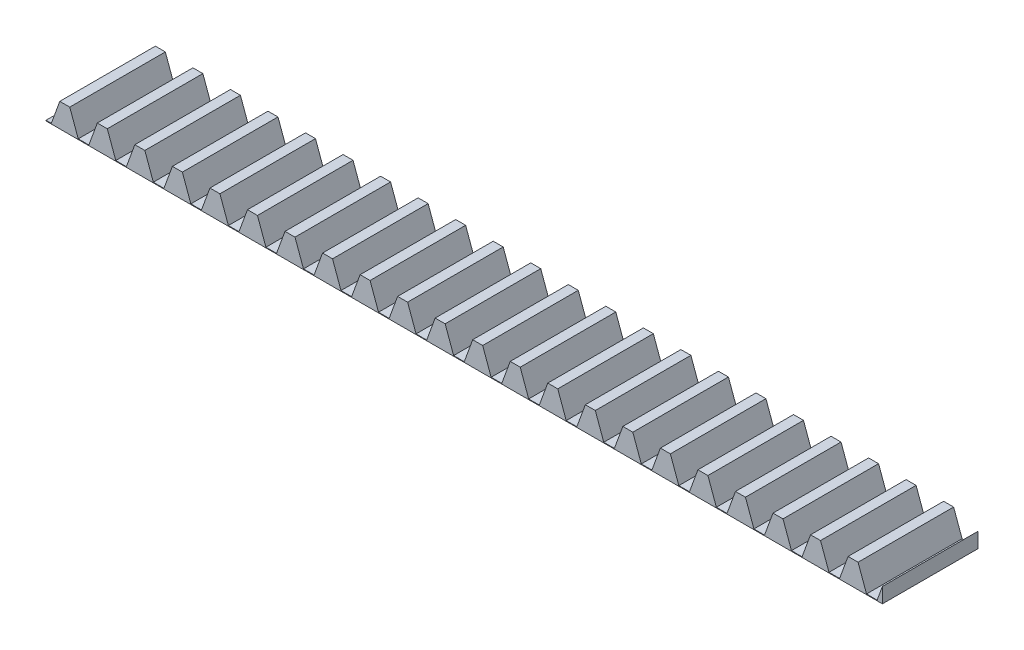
ISO-10303-21;
HEADER;
FILE_DESCRIPTION(('STEP AP214'),'2;1');
FILE_NAME('part.step','',(''),(''),'','','');
FILE_SCHEMA(('AUTOMOTIVE_DESIGN { 1 0 10303 214 1 1 1 1 }'));
ENDSEC;
DATA;
#1=APPLICATION_CONTEXT('core data for automotive mechanical design processes');
#2=APPLICATION_PROTOCOL_DEFINITION('international standard','automotive_design',2000,#1);
#3=PRODUCT_CONTEXT('',#1,'mechanical');
#4=PRODUCT('Part','Part','',(#3));
#5=PRODUCT_RELATED_PRODUCT_CATEGORY('part','',(#4));
#6=PRODUCT_DEFINITION_FORMATION('','',#4);
#7=PRODUCT_DEFINITION_CONTEXT('part definition',#1,'design');
#8=PRODUCT_DEFINITION('design','',#6,#7);
#9=PRODUCT_DEFINITION_SHAPE('','',#8);
#10=(LENGTH_UNIT() NAMED_UNIT(*) SI_UNIT(.MILLI.,.METRE.));
#11=(NAMED_UNIT(*) PLANE_ANGLE_UNIT() SI_UNIT($,.RADIAN.));
#12=(NAMED_UNIT(*) SI_UNIT($,.STERADIAN.) SOLID_ANGLE_UNIT());
#13=UNCERTAINTY_MEASURE_WITH_UNIT(LENGTH_MEASURE(1.E-05),#10,'distance_accuracy_value','');
#14=(GEOMETRIC_REPRESENTATION_CONTEXT(3) GLOBAL_UNCERTAINTY_ASSIGNED_CONTEXT((#13)) GLOBAL_UNIT_ASSIGNED_CONTEXT((#10,
#11,#12)) REPRESENTATION_CONTEXT('',''));
#15=CARTESIAN_POINT('',(0.,0.,0.));
#16=DIRECTION('',(0.,0.,1.));
#17=DIRECTION('',(1.,0.,0.));
#18=AXIS2_PLACEMENT_3D('',#15,#16,#17);
#19=CARTESIAN_POINT('',(0.,2.,-8.));
#20=DIRECTION('',(0.,1.,0.));
#21=DIRECTION('',(0.,0.,1.));
#22=AXIS2_PLACEMENT_3D('',#19,#20,#21);
#23=PLANE('',#22);
#24=DIRECTION('',(0.,0.,1.));
#25=VECTOR('',#24,1.);
#26=CARTESIAN_POINT('',(64.8202874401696,2.,-8.));
#27=LINE('',#26,#25);
#28=CARTESIAN_POINT('',(64.8202874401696,2.,-8.));
#29=VERTEX_POINT('',#28);
#30=CARTESIAN_POINT('',(64.8202874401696,2.,0.));
#31=VERTEX_POINT('',#30);
#32=EDGE_CURVE('E664',#29,#31,#27,.T.);
#33=ORIENTED_EDGE('',*,*,#32,.F.);
#34=DIRECTION('',(-1.,0.,0.));
#35=VECTOR('',#34,1.);
#36=CARTESIAN_POINT('',(0.,2.,-8.));
#37=LINE('',#36,#35);
#38=CARTESIAN_POINT('',(63.9850112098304,2.,-8.));
#39=VERTEX_POINT('',#38);
#40=EDGE_CURVE('E1176',#29,#39,#37,.T.);
#41=ORIENTED_EDGE('',*,*,#40,.T.);
#42=DIRECTION('',(0.,0.,-1.));
#43=VECTOR('',#42,1.);
#44=CARTESIAN_POINT('',(63.9850112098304,2.,-8.));
#45=LINE('',#44,#43);
#46=CARTESIAN_POINT('',(63.9850112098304,2.,0.));
#47=VERTEX_POINT('',#46);
#48=EDGE_CURVE('E684',#47,#39,#45,.T.);
#49=ORIENTED_EDGE('',*,*,#48,.F.);
#50=DIRECTION('',(-1.,0.,0.));
#51=VECTOR('',#50,1.);
#52=CARTESIAN_POINT('',(0.,2.,0.));
#53=LINE('',#52,#51);
#54=EDGE_CURVE('E1186',#31,#47,#53,.T.);
#55=ORIENTED_EDGE('',*,*,#54,.F.);
#56=EDGE_LOOP('',(#33,#41,#49,#55));
#57=FACE_BOUND('',#56,.T.);
#58=ADVANCED_FACE('F39',(#57),#23,.T.);
#59=DIRECTION('',(0.,0.,1.));
#60=VECTOR('',#59,1.);
#61=CARTESIAN_POINT('',(61.6786947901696,2.,-8.));
#62=LINE('',#61,#60);
#63=CARTESIAN_POINT('',(61.6786947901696,1.99999999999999,-8.));
#64=VERTEX_POINT('',#63);
#65=CARTESIAN_POINT('',(61.6786947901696,1.99999999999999,0.));
#66=VERTEX_POINT('',#65);
#67=EDGE_CURVE('E688',#64,#66,#62,.T.);
#68=ORIENTED_EDGE('',*,*,#67,.F.);
#69=CARTESIAN_POINT('',(60.8434185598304,2.,-8.));
#70=VERTEX_POINT('',#69);
#71=EDGE_CURVE('E1420',#64,#70,#37,.T.);
#72=ORIENTED_EDGE('',*,*,#71,.T.);
#73=DIRECTION('',(0.,0.,-1.));
#74=VECTOR('',#73,1.);
#75=CARTESIAN_POINT('',(60.8434185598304,2.,-8.));
#76=LINE('',#75,#74);
#77=CARTESIAN_POINT('',(60.8434185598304,2.,0.));
#78=VERTEX_POINT('',#77);
#79=EDGE_CURVE('E708',#78,#70,#76,.T.);
#80=ORIENTED_EDGE('',*,*,#79,.F.);
#81=EDGE_CURVE('E1265',#66,#78,#53,.T.);
#82=ORIENTED_EDGE('',*,*,#81,.F.);
#83=EDGE_LOOP('',(#68,#72,#80,#82));
#84=FACE_BOUND('',#83,.T.);
#85=ADVANCED_FACE('F1438',(#84),#23,.T.);
#86=DIRECTION('',(0.,0.,1.));
#87=VECTOR('',#86,1.);
#88=CARTESIAN_POINT('',(58.5371021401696,2.,-8.));
#89=LINE('',#88,#87);
#90=CARTESIAN_POINT('',(58.5371021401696,2.,-8.));
#91=VERTEX_POINT('',#90);
#92=CARTESIAN_POINT('',(58.5371021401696,2.,0.));
#93=VERTEX_POINT('',#92);
#94=EDGE_CURVE('E712',#91,#93,#89,.T.);
#95=ORIENTED_EDGE('',*,*,#94,.F.);
#96=CARTESIAN_POINT('',(57.7018259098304,2.,-8.));
#97=VERTEX_POINT('',#96);
#98=EDGE_CURVE('E1415',#91,#97,#37,.T.);
#99=ORIENTED_EDGE('',*,*,#98,.T.);
#100=DIRECTION('',(0.,0.,-1.));
#101=VECTOR('',#100,1.);
#102=CARTESIAN_POINT('',(57.7018259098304,2.,-8.));
#103=LINE('',#102,#101);
#104=CARTESIAN_POINT('',(57.7018259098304,2.,0.));
#105=VERTEX_POINT('',#104);
#106=EDGE_CURVE('E732',#105,#97,#103,.T.);
#107=ORIENTED_EDGE('',*,*,#106,.F.);
#108=EDGE_CURVE('E1266',#93,#105,#53,.T.);
#109=ORIENTED_EDGE('',*,*,#108,.F.);
#110=EDGE_LOOP('',(#95,#99,#107,#109));
#111=FACE_BOUND('',#110,.T.);
#112=ADVANCED_FACE('F1448',(#111),#23,.T.);
#113=DIRECTION('',(0.,0.,1.));
#114=VECTOR('',#113,1.);
#115=CARTESIAN_POINT('',(55.3955094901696,2.,-8.));
#116=LINE('',#115,#114);
#117=CARTESIAN_POINT('',(55.3955094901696,2.,-8.));
#118=VERTEX_POINT('',#117);
#119=CARTESIAN_POINT('',(55.3955094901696,2.,0.));
#120=VERTEX_POINT('',#119);
#121=EDGE_CURVE('E736',#118,#120,#116,.T.);
#122=ORIENTED_EDGE('',*,*,#121,.F.);
#123=CARTESIAN_POINT('',(54.5602332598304,2.,-8.));
#124=VERTEX_POINT('',#123);
#125=EDGE_CURVE('E1410',#118,#124,#37,.T.);
#126=ORIENTED_EDGE('',*,*,#125,.T.);
#127=DIRECTION('',(0.,0.,-1.));
#128=VECTOR('',#127,1.);
#129=CARTESIAN_POINT('',(54.5602332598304,2.,-8.));
#130=LINE('',#129,#128);
#131=CARTESIAN_POINT('',(54.5602332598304,2.,0.));
#132=VERTEX_POINT('',#131);
#133=EDGE_CURVE('E756',#132,#124,#130,.T.);
#134=ORIENTED_EDGE('',*,*,#133,.F.);
#135=EDGE_CURVE('E1269',#120,#132,#53,.T.);
#136=ORIENTED_EDGE('',*,*,#135,.F.);
#137=EDGE_LOOP('',(#122,#126,#134,#136));
#138=FACE_BOUND('',#137,.T.);
#139=ADVANCED_FACE('F1458',(#138),#23,.T.);
#140=DIRECTION('',(0.,0.,1.));
#141=VECTOR('',#140,1.);
#142=CARTESIAN_POINT('',(52.2539168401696,2.,-8.));
#143=LINE('',#142,#141);
#144=CARTESIAN_POINT('',(52.2539168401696,2.,-8.));
#145=VERTEX_POINT('',#144);
#146=CARTESIAN_POINT('',(52.2539168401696,2.,0.));
#147=VERTEX_POINT('',#146);
#148=EDGE_CURVE('E760',#145,#147,#143,.T.);
#149=ORIENTED_EDGE('',*,*,#148,.F.);
#150=CARTESIAN_POINT('',(51.4186406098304,2.,-8.));
#151=VERTEX_POINT('',#150);
#152=EDGE_CURVE('E1405',#145,#151,#37,.T.);
#153=ORIENTED_EDGE('',*,*,#152,.T.);
#154=DIRECTION('',(0.,0.,-1.));
#155=VECTOR('',#154,1.);
#156=CARTESIAN_POINT('',(51.4186406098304,2.,-8.));
#157=LINE('',#156,#155);
#158=CARTESIAN_POINT('',(51.4186406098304,2.,0.));
#159=VERTEX_POINT('',#158);
#160=EDGE_CURVE('E780',#159,#151,#157,.T.);
#161=ORIENTED_EDGE('',*,*,#160,.F.);
#162=EDGE_CURVE('E1272',#147,#159,#53,.T.);
#163=ORIENTED_EDGE('',*,*,#162,.F.);
#164=EDGE_LOOP('',(#149,#153,#161,#163));
#165=FACE_BOUND('',#164,.T.);
#166=ADVANCED_FACE('F1468',(#165),#23,.T.);
#167=DIRECTION('',(0.,0.,1.));
#168=VECTOR('',#167,1.);
#169=CARTESIAN_POINT('',(49.1123241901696,2.,-8.));
#170=LINE('',#169,#168);
#171=CARTESIAN_POINT('',(49.1123241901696,2.,-8.));
#172=VERTEX_POINT('',#171);
#173=CARTESIAN_POINT('',(49.1123241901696,2.,0.));
#174=VERTEX_POINT('',#173);
#175=EDGE_CURVE('E784',#172,#174,#170,.T.);
#176=ORIENTED_EDGE('',*,*,#175,.F.);
#177=CARTESIAN_POINT('',(48.2770479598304,2.,-8.));
#178=VERTEX_POINT('',#177);
#179=EDGE_CURVE('E1400',#172,#178,#37,.T.);
#180=ORIENTED_EDGE('',*,*,#179,.T.);
#181=DIRECTION('',(0.,0.,-1.));
#182=VECTOR('',#181,1.);
#183=CARTESIAN_POINT('',(48.2770479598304,2.,-8.));
#184=LINE('',#183,#182);
#185=CARTESIAN_POINT('',(48.2770479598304,2.,0.));
#186=VERTEX_POINT('',#185);
#187=EDGE_CURVE('E804',#186,#178,#184,.T.);
#188=ORIENTED_EDGE('',*,*,#187,.F.);
#189=EDGE_CURVE('E1275',#174,#186,#53,.T.);
#190=ORIENTED_EDGE('',*,*,#189,.F.);
#191=EDGE_LOOP('',(#176,#180,#188,#190));
#192=FACE_BOUND('',#191,.T.);
#193=ADVANCED_FACE('F1478',(#192),#23,.T.);
#194=DIRECTION('',(0.,0.,1.));
#195=VECTOR('',#194,1.);
#196=CARTESIAN_POINT('',(45.9707315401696,2.,-8.));
#197=LINE('',#196,#195);
#198=CARTESIAN_POINT('',(45.9707315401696,2.,-8.));
#199=VERTEX_POINT('',#198);
#200=CARTESIAN_POINT('',(45.9707315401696,2.,0.));
#201=VERTEX_POINT('',#200);
#202=EDGE_CURVE('E808',#199,#201,#197,.T.);
#203=ORIENTED_EDGE('',*,*,#202,.F.);
#204=CARTESIAN_POINT('',(45.1354553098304,2.,-8.));
#205=VERTEX_POINT('',#204);
#206=EDGE_CURVE('E1395',#199,#205,#37,.T.);
#207=ORIENTED_EDGE('',*,*,#206,.T.);
#208=DIRECTION('',(0.,0.,-1.));
#209=VECTOR('',#208,1.);
#210=CARTESIAN_POINT('',(45.1354553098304,2.,-8.));
#211=LINE('',#210,#209);
#212=CARTESIAN_POINT('',(45.1354553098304,2.,0.));
#213=VERTEX_POINT('',#212);
#214=EDGE_CURVE('E828',#213,#205,#211,.T.);
#215=ORIENTED_EDGE('',*,*,#214,.F.);
#216=EDGE_CURVE('E1278',#201,#213,#53,.T.);
#217=ORIENTED_EDGE('',*,*,#216,.F.);
#218=EDGE_LOOP('',(#203,#207,#215,#217));
#219=FACE_BOUND('',#218,.T.);
#220=ADVANCED_FACE('F1488',(#219),#23,.T.);
#221=DIRECTION('',(0.,0.,1.));
#222=VECTOR('',#221,1.);
#223=CARTESIAN_POINT('',(42.8291388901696,2.,-8.));
#224=LINE('',#223,#222);
#225=CARTESIAN_POINT('',(42.8291388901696,2.,-8.));
#226=VERTEX_POINT('',#225);
#227=CARTESIAN_POINT('',(42.8291388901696,2.,0.));
#228=VERTEX_POINT('',#227);
#229=EDGE_CURVE('E832',#226,#228,#224,.T.);
#230=ORIENTED_EDGE('',*,*,#229,.F.);
#231=CARTESIAN_POINT('',(41.9938626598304,2.,-8.));
#232=VERTEX_POINT('',#231);
#233=EDGE_CURVE('E1390',#226,#232,#37,.T.);
#234=ORIENTED_EDGE('',*,*,#233,.T.);
#235=DIRECTION('',(0.,0.,-1.));
#236=VECTOR('',#235,1.);
#237=CARTESIAN_POINT('',(41.9938626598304,2.,-8.));
#238=LINE('',#237,#236);
#239=CARTESIAN_POINT('',(41.9938626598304,2.,0.));
#240=VERTEX_POINT('',#239);
#241=EDGE_CURVE('E852',#240,#232,#238,.T.);
#242=ORIENTED_EDGE('',*,*,#241,.F.);
#243=EDGE_CURVE('E1281',#228,#240,#53,.T.);
#244=ORIENTED_EDGE('',*,*,#243,.F.);
#245=EDGE_LOOP('',(#230,#234,#242,#244));
#246=FACE_BOUND('',#245,.T.);
#247=ADVANCED_FACE('F1498',(#246),#23,.T.);
#248=DIRECTION('',(0.,0.,1.));
#249=VECTOR('',#248,1.);
#250=CARTESIAN_POINT('',(39.6875462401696,2.,-8.));
#251=LINE('',#250,#249);
#252=CARTESIAN_POINT('',(39.6875462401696,2.,-8.));
#253=VERTEX_POINT('',#252);
#254=CARTESIAN_POINT('',(39.6875462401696,2.,0.));
#255=VERTEX_POINT('',#254);
#256=EDGE_CURVE('E856',#253,#255,#251,.T.);
#257=ORIENTED_EDGE('',*,*,#256,.F.);
#258=CARTESIAN_POINT('',(38.8522700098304,2.,-8.));
#259=VERTEX_POINT('',#258);
#260=EDGE_CURVE('E1385',#253,#259,#37,.T.);
#261=ORIENTED_EDGE('',*,*,#260,.T.);
#262=DIRECTION('',(0.,0.,-1.));
#263=VECTOR('',#262,1.);
#264=CARTESIAN_POINT('',(38.8522700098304,2.,-8.));
#265=LINE('',#264,#263);
#266=CARTESIAN_POINT('',(38.8522700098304,2.,0.));
#267=VERTEX_POINT('',#266);
#268=EDGE_CURVE('E876',#267,#259,#265,.T.);
#269=ORIENTED_EDGE('',*,*,#268,.F.);
#270=EDGE_CURVE('E1284',#255,#267,#53,.T.);
#271=ORIENTED_EDGE('',*,*,#270,.F.);
#272=EDGE_LOOP('',(#257,#261,#269,#271));
#273=FACE_BOUND('',#272,.T.);
#274=ADVANCED_FACE('F1508',(#273),#23,.T.);
#275=DIRECTION('',(0.,0.,1.));
#276=VECTOR('',#275,1.);
#277=CARTESIAN_POINT('',(36.5459535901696,2.,-8.));
#278=LINE('',#277,#276);
#279=CARTESIAN_POINT('',(36.5459535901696,2.,-8.));
#280=VERTEX_POINT('',#279);
#281=CARTESIAN_POINT('',(36.5459535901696,2.,0.));
#282=VERTEX_POINT('',#281);
#283=EDGE_CURVE('E880',#280,#282,#278,.T.);
#284=ORIENTED_EDGE('',*,*,#283,.F.);
#285=CARTESIAN_POINT('',(35.7106773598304,2.,-8.));
#286=VERTEX_POINT('',#285);
#287=EDGE_CURVE('E1380',#280,#286,#37,.T.);
#288=ORIENTED_EDGE('',*,*,#287,.T.);
#289=DIRECTION('',(0.,0.,-1.));
#290=VECTOR('',#289,1.);
#291=CARTESIAN_POINT('',(35.7106773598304,2.,-8.));
#292=LINE('',#291,#290);
#293=CARTESIAN_POINT('',(35.7106773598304,2.,0.));
#294=VERTEX_POINT('',#293);
#295=EDGE_CURVE('E900',#294,#286,#292,.T.);
#296=ORIENTED_EDGE('',*,*,#295,.F.);
#297=EDGE_CURVE('E1287',#282,#294,#53,.T.);
#298=ORIENTED_EDGE('',*,*,#297,.F.);
#299=EDGE_LOOP('',(#284,#288,#296,#298));
#300=FACE_BOUND('',#299,.T.);
#301=ADVANCED_FACE('F1518',(#300),#23,.T.);
#302=DIRECTION('',(0.,0.,1.));
#303=VECTOR('',#302,1.);
#304=CARTESIAN_POINT('',(33.4043609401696,2.,-8.));
#305=LINE('',#304,#303);
#306=CARTESIAN_POINT('',(33.4043609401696,2.,-8.));
#307=VERTEX_POINT('',#306);
#308=CARTESIAN_POINT('',(33.4043609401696,2.,0.));
#309=VERTEX_POINT('',#308);
#310=EDGE_CURVE('E904',#307,#309,#305,.T.);
#311=ORIENTED_EDGE('',*,*,#310,.F.);
#312=CARTESIAN_POINT('',(32.5690847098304,2.,-8.));
#313=VERTEX_POINT('',#312);
#314=EDGE_CURVE('E1375',#307,#313,#37,.T.);
#315=ORIENTED_EDGE('',*,*,#314,.T.);
#316=DIRECTION('',(0.,0.,-1.));
#317=VECTOR('',#316,1.);
#318=CARTESIAN_POINT('',(32.5690847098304,2.,-8.));
#319=LINE('',#318,#317);
#320=CARTESIAN_POINT('',(32.5690847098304,2.,0.));
#321=VERTEX_POINT('',#320);
#322=EDGE_CURVE('E924',#321,#313,#319,.T.);
#323=ORIENTED_EDGE('',*,*,#322,.F.);
#324=EDGE_CURVE('E1290',#309,#321,#53,.T.);
#325=ORIENTED_EDGE('',*,*,#324,.F.);
#326=EDGE_LOOP('',(#311,#315,#323,#325));
#327=FACE_BOUND('',#326,.T.);
#328=ADVANCED_FACE('F1528',(#327),#23,.T.);
#329=DIRECTION('',(0.,0.,1.));
#330=VECTOR('',#329,1.);
#331=CARTESIAN_POINT('',(30.2627682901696,2.,-8.));
#332=LINE('',#331,#330);
#333=CARTESIAN_POINT('',(30.2627682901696,2.,-8.));
#334=VERTEX_POINT('',#333);
#335=CARTESIAN_POINT('',(30.2627682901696,2.,0.));
#336=VERTEX_POINT('',#335);
#337=EDGE_CURVE('E928',#334,#336,#332,.T.);
#338=ORIENTED_EDGE('',*,*,#337,.F.);
#339=CARTESIAN_POINT('',(29.4274920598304,2.,-8.));
#340=VERTEX_POINT('',#339);
#341=EDGE_CURVE('E1370',#334,#340,#37,.T.);
#342=ORIENTED_EDGE('',*,*,#341,.T.);
#343=DIRECTION('',(0.,0.,-1.));
#344=VECTOR('',#343,1.);
#345=CARTESIAN_POINT('',(29.4274920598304,2.,-8.));
#346=LINE('',#345,#344);
#347=CARTESIAN_POINT('',(29.4274920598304,2.,0.));
#348=VERTEX_POINT('',#347);
#349=EDGE_CURVE('E948',#348,#340,#346,.T.);
#350=ORIENTED_EDGE('',*,*,#349,.F.);
#351=EDGE_CURVE('E1293',#336,#348,#53,.T.);
#352=ORIENTED_EDGE('',*,*,#351,.F.);
#353=EDGE_LOOP('',(#338,#342,#350,#352));
#354=FACE_BOUND('',#353,.T.);
#355=ADVANCED_FACE('F1538',(#354),#23,.T.);
#356=DIRECTION('',(0.,0.,1.));
#357=VECTOR('',#356,1.);
#358=CARTESIAN_POINT('',(27.1211756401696,2.,-8.));
#359=LINE('',#358,#357);
#360=CARTESIAN_POINT('',(27.1211756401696,2.,-8.));
#361=VERTEX_POINT('',#360);
#362=CARTESIAN_POINT('',(27.1211756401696,2.,0.));
#363=VERTEX_POINT('',#362);
#364=EDGE_CURVE('E952',#361,#363,#359,.T.);
#365=ORIENTED_EDGE('',*,*,#364,.F.);
#366=CARTESIAN_POINT('',(26.2858994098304,2.,-8.));
#367=VERTEX_POINT('',#366);
#368=EDGE_CURVE('E1365',#361,#367,#37,.T.);
#369=ORIENTED_EDGE('',*,*,#368,.T.);
#370=DIRECTION('',(0.,0.,-1.));
#371=VECTOR('',#370,1.);
#372=CARTESIAN_POINT('',(26.2858994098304,2.,-8.));
#373=LINE('',#372,#371);
#374=CARTESIAN_POINT('',(26.2858994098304,2.,0.));
#375=VERTEX_POINT('',#374);
#376=EDGE_CURVE('E972',#375,#367,#373,.T.);
#377=ORIENTED_EDGE('',*,*,#376,.F.);
#378=EDGE_CURVE('E1296',#363,#375,#53,.T.);
#379=ORIENTED_EDGE('',*,*,#378,.F.);
#380=EDGE_LOOP('',(#365,#369,#377,#379));
#381=FACE_BOUND('',#380,.T.);
#382=ADVANCED_FACE('F1548',(#381),#23,.T.);
#383=DIRECTION('',(0.,0.,1.));
#384=VECTOR('',#383,1.);
#385=CARTESIAN_POINT('',(23.9795829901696,2.,-8.));
#386=LINE('',#385,#384);
#387=CARTESIAN_POINT('',(23.9795829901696,2.,-8.));
#388=VERTEX_POINT('',#387);
#389=CARTESIAN_POINT('',(23.9795829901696,2.,0.));
#390=VERTEX_POINT('',#389);
#391=EDGE_CURVE('E976',#388,#390,#386,.T.);
#392=ORIENTED_EDGE('',*,*,#391,.F.);
#393=CARTESIAN_POINT('',(23.1443067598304,2.,-8.));
#394=VERTEX_POINT('',#393);
#395=EDGE_CURVE('E1360',#388,#394,#37,.T.);
#396=ORIENTED_EDGE('',*,*,#395,.T.);
#397=DIRECTION('',(0.,0.,-1.));
#398=VECTOR('',#397,1.);
#399=CARTESIAN_POINT('',(23.1443067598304,2.,-8.));
#400=LINE('',#399,#398);
#401=CARTESIAN_POINT('',(23.1443067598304,2.,0.));
#402=VERTEX_POINT('',#401);
#403=EDGE_CURVE('E996',#402,#394,#400,.T.);
#404=ORIENTED_EDGE('',*,*,#403,.F.);
#405=EDGE_CURVE('E1299',#390,#402,#53,.T.);
#406=ORIENTED_EDGE('',*,*,#405,.F.);
#407=EDGE_LOOP('',(#392,#396,#404,#406));
#408=FACE_BOUND('',#407,.T.);
#409=ADVANCED_FACE('F1558',(#408),#23,.T.);
#410=DIRECTION('',(0.,0.,1.));
#411=VECTOR('',#410,1.);
#412=CARTESIAN_POINT('',(20.8379903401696,2.,-8.));
#413=LINE('',#412,#411);
#414=CARTESIAN_POINT('',(20.8379903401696,2.,-8.));
#415=VERTEX_POINT('',#414);
#416=CARTESIAN_POINT('',(20.8379903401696,2.,0.));
#417=VERTEX_POINT('',#416);
#418=EDGE_CURVE('E1000',#415,#417,#413,.T.);
#419=ORIENTED_EDGE('',*,*,#418,.F.);
#420=CARTESIAN_POINT('',(20.0027141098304,2.,-8.));
#421=VERTEX_POINT('',#420);
#422=EDGE_CURVE('E1355',#415,#421,#37,.T.);
#423=ORIENTED_EDGE('',*,*,#422,.T.);
#424=DIRECTION('',(0.,0.,-1.));
#425=VECTOR('',#424,1.);
#426=CARTESIAN_POINT('',(20.0027141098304,2.,-8.));
#427=LINE('',#426,#425);
#428=CARTESIAN_POINT('',(20.0027141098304,2.,0.));
#429=VERTEX_POINT('',#428);
#430=EDGE_CURVE('E1020',#429,#421,#427,.T.);
#431=ORIENTED_EDGE('',*,*,#430,.F.);
#432=EDGE_CURVE('E1302',#417,#429,#53,.T.);
#433=ORIENTED_EDGE('',*,*,#432,.F.);
#434=EDGE_LOOP('',(#419,#423,#431,#433));
#435=FACE_BOUND('',#434,.T.);
#436=ADVANCED_FACE('F1568',(#435),#23,.T.);
#437=DIRECTION('',(0.,0.,1.));
#438=VECTOR('',#437,1.);
#439=CARTESIAN_POINT('',(17.6963976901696,2.,-8.));
#440=LINE('',#439,#438);
#441=CARTESIAN_POINT('',(17.6963976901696,2.,-8.));
#442=VERTEX_POINT('',#441);
#443=CARTESIAN_POINT('',(17.6963976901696,2.,0.));
#444=VERTEX_POINT('',#443);
#445=EDGE_CURVE('E1024',#442,#444,#440,.T.);
#446=ORIENTED_EDGE('',*,*,#445,.F.);
#447=CARTESIAN_POINT('',(16.8611214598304,2.,-8.));
#448=VERTEX_POINT('',#447);
#449=EDGE_CURVE('E1350',#442,#448,#37,.T.);
#450=ORIENTED_EDGE('',*,*,#449,.T.);
#451=DIRECTION('',(0.,0.,-1.));
#452=VECTOR('',#451,1.);
#453=CARTESIAN_POINT('',(16.8611214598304,2.,-8.));
#454=LINE('',#453,#452);
#455=CARTESIAN_POINT('',(16.8611214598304,2.,0.));
#456=VERTEX_POINT('',#455);
#457=EDGE_CURVE('E1044',#456,#448,#454,.T.);
#458=ORIENTED_EDGE('',*,*,#457,.F.);
#459=EDGE_CURVE('E1305',#444,#456,#53,.T.);
#460=ORIENTED_EDGE('',*,*,#459,.F.);
#461=EDGE_LOOP('',(#446,#450,#458,#460));
#462=FACE_BOUND('',#461,.T.);
#463=ADVANCED_FACE('F1578',(#462),#23,.T.);
#464=DIRECTION('',(0.,0.,1.));
#465=VECTOR('',#464,1.);
#466=CARTESIAN_POINT('',(14.5548050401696,2.,-8.));
#467=LINE('',#466,#465);
#468=CARTESIAN_POINT('',(14.5548050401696,2.,-8.));
#469=VERTEX_POINT('',#468);
#470=CARTESIAN_POINT('',(14.5548050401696,2.,0.));
#471=VERTEX_POINT('',#470);
#472=EDGE_CURVE('E1048',#469,#471,#467,.T.);
#473=ORIENTED_EDGE('',*,*,#472,.F.);
#474=CARTESIAN_POINT('',(13.7195288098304,2.,-8.));
#475=VERTEX_POINT('',#474);
#476=EDGE_CURVE('E1345',#469,#475,#37,.T.);
#477=ORIENTED_EDGE('',*,*,#476,.T.);
#478=DIRECTION('',(0.,0.,-1.));
#479=VECTOR('',#478,1.);
#480=CARTESIAN_POINT('',(13.7195288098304,2.,-8.));
#481=LINE('',#480,#479);
#482=CARTESIAN_POINT('',(13.7195288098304,2.,0.));
#483=VERTEX_POINT('',#482);
#484=EDGE_CURVE('E1068',#483,#475,#481,.T.);
#485=ORIENTED_EDGE('',*,*,#484,.F.);
#486=EDGE_CURVE('E1308',#471,#483,#53,.T.);
#487=ORIENTED_EDGE('',*,*,#486,.F.);
#488=EDGE_LOOP('',(#473,#477,#485,#487));
#489=FACE_BOUND('',#488,.T.);
#490=ADVANCED_FACE('F1588',(#489),#23,.T.);
#491=DIRECTION('',(0.,0.,1.));
#492=VECTOR('',#491,1.);
#493=CARTESIAN_POINT('',(11.4132123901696,2.,-8.));
#494=LINE('',#493,#492);
#495=CARTESIAN_POINT('',(11.4132123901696,2.,-8.));
#496=VERTEX_POINT('',#495);
#497=CARTESIAN_POINT('',(11.4132123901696,2.,0.));
#498=VERTEX_POINT('',#497);
#499=EDGE_CURVE('E1072',#496,#498,#494,.T.);
#500=ORIENTED_EDGE('',*,*,#499,.F.);
#501=CARTESIAN_POINT('',(10.5779361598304,2.,-8.));
#502=VERTEX_POINT('',#501);
#503=EDGE_CURVE('E1340',#496,#502,#37,.T.);
#504=ORIENTED_EDGE('',*,*,#503,.T.);
#505=DIRECTION('',(0.,0.,-1.));
#506=VECTOR('',#505,1.);
#507=CARTESIAN_POINT('',(10.5779361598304,2.,-8.));
#508=LINE('',#507,#506);
#509=CARTESIAN_POINT('',(10.5779361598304,2.,0.));
#510=VERTEX_POINT('',#509);
#511=EDGE_CURVE('E1092',#510,#502,#508,.T.);
#512=ORIENTED_EDGE('',*,*,#511,.F.);
#513=EDGE_CURVE('E1311',#498,#510,#53,.T.);
#514=ORIENTED_EDGE('',*,*,#513,.F.);
#515=EDGE_LOOP('',(#500,#504,#512,#514));
#516=FACE_BOUND('',#515,.T.);
#517=ADVANCED_FACE('F1598',(#516),#23,.T.);
#518=DIRECTION('',(0.,0.,1.));
#519=VECTOR('',#518,1.);
#520=CARTESIAN_POINT('',(8.27161974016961,2.,-8.));
#521=LINE('',#520,#519);
#522=CARTESIAN_POINT('',(8.27161974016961,2.,-8.));
#523=VERTEX_POINT('',#522);
#524=CARTESIAN_POINT('',(8.27161974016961,2.,0.));
#525=VERTEX_POINT('',#524);
#526=EDGE_CURVE('E1096',#523,#525,#521,.T.);
#527=ORIENTED_EDGE('',*,*,#526,.F.);
#528=CARTESIAN_POINT('',(7.43634350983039,2.,-8.));
#529=VERTEX_POINT('',#528);
#530=EDGE_CURVE('E1335',#523,#529,#37,.T.);
#531=ORIENTED_EDGE('',*,*,#530,.T.);
#532=DIRECTION('',(0.,0.,-1.));
#533=VECTOR('',#532,1.);
#534=CARTESIAN_POINT('',(7.43634350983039,2.,-8.));
#535=LINE('',#534,#533);
#536=CARTESIAN_POINT('',(7.43634350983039,2.,0.));
#537=VERTEX_POINT('',#536);
#538=EDGE_CURVE('E1116',#537,#529,#535,.T.);
#539=ORIENTED_EDGE('',*,*,#538,.F.);
#540=EDGE_CURVE('E1314',#525,#537,#53,.T.);
#541=ORIENTED_EDGE('',*,*,#540,.F.);
#542=EDGE_LOOP('',(#527,#531,#539,#541));
#543=FACE_BOUND('',#542,.T.);
#544=ADVANCED_FACE('F1608',(#543),#23,.T.);
#545=DIRECTION('',(0.,0.,1.));
#546=VECTOR('',#545,1.);
#547=CARTESIAN_POINT('',(5.13002709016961,2.,-8.));
#548=LINE('',#547,#546);
#549=CARTESIAN_POINT('',(5.13002709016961,2.,-8.));
#550=VERTEX_POINT('',#549);
#551=CARTESIAN_POINT('',(5.13002709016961,2.,0.));
#552=VERTEX_POINT('',#551);
#553=EDGE_CURVE('E1120',#550,#552,#548,.T.);
#554=ORIENTED_EDGE('',*,*,#553,.F.);
#555=CARTESIAN_POINT('',(4.29475085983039,2.,-8.));
#556=VERTEX_POINT('',#555);
#557=EDGE_CURVE('E1334',#550,#556,#37,.T.);
#558=ORIENTED_EDGE('',*,*,#557,.T.);
#559=DIRECTION('',(0.,0.,-1.));
#560=VECTOR('',#559,1.);
#561=CARTESIAN_POINT('',(4.29475085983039,2.,-8.));
#562=LINE('',#561,#560);
#563=CARTESIAN_POINT('',(4.29475085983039,2.,0.));
#564=VERTEX_POINT('',#563);
#565=EDGE_CURVE('E1140',#564,#556,#562,.T.);
#566=ORIENTED_EDGE('',*,*,#565,.F.);
#567=EDGE_CURVE('E1317',#552,#564,#53,.T.);
#568=ORIENTED_EDGE('',*,*,#567,.F.);
#569=EDGE_LOOP('',(#554,#558,#566,#568));
#570=FACE_BOUND('',#569,.T.);
#571=ADVANCED_FACE('F1618',(#570),#23,.T.);
#572=DIRECTION('',(0.,0.,1.));
#573=VECTOR('',#572,1.);
#574=CARTESIAN_POINT('',(1.98843444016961,2.,-8.));
#575=LINE('',#574,#573);
#576=CARTESIAN_POINT('',(1.98843444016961,2.,-8.));
#577=VERTEX_POINT('',#576);
#578=CARTESIAN_POINT('',(1.98843444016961,2.,0.));
#579=VERTEX_POINT('',#578);
#580=EDGE_CURVE('E1144',#577,#579,#575,.T.);
#581=ORIENTED_EDGE('',*,*,#580,.F.);
#582=CARTESIAN_POINT('',(1.15315820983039,2.,-8.));
#583=VERTEX_POINT('',#582);
#584=EDGE_CURVE('E1173',#577,#583,#37,.T.);
#585=ORIENTED_EDGE('',*,*,#584,.T.);
#586=DIRECTION('',(0.,0.,-1.));
#587=VECTOR('',#586,1.);
#588=CARTESIAN_POINT('',(1.15315820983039,2.,-8.));
#589=LINE('',#588,#587);
#590=CARTESIAN_POINT('',(1.15315820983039,2.,0.));
#591=VERTEX_POINT('',#590);
#592=EDGE_CURVE('E1160',#591,#583,#589,.T.);
#593=ORIENTED_EDGE('',*,*,#592,.F.);
#594=EDGE_CURVE('E1184',#579,#591,#53,.T.);
#595=ORIENTED_EDGE('',*,*,#594,.F.);
#596=EDGE_LOOP('',(#581,#585,#593,#595));
#597=FACE_BOUND('',#596,.T.);
#598=ADVANCED_FACE('F1332',(#597),#23,.T.);
#599=CARTESIAN_POINT('',(0.,0.,-8.));
#600=DIRECTION('',(-1.,0.,0.));
#601=DIRECTION('',(0.,0.,1.));
#602=AXIS2_PLACEMENT_3D('',#599,#600,#601);
#603=PLANE('',#602);
#604=DIRECTION('',(0.,0.,1.));
#605=VECTOR('',#604,1.);
#606=CARTESIAN_POINT('',(0.,0.0527999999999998,-8.));
#607=LINE('',#606,#605);
#608=CARTESIAN_POINT('',(0.,0.0527999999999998,-8.));
#609=VERTEX_POINT('',#608);
#610=CARTESIAN_POINT('',(0.,0.0527999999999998,0.));
#611=VERTEX_POINT('',#610);
#612=EDGE_CURVE('E1158',#609,#611,#607,.T.);
#613=ORIENTED_EDGE('',*,*,#612,.F.);
#614=DIRECTION('',(0.,-1.,0.));
#615=VECTOR('',#614,1.);
#616=CARTESIAN_POINT('',(0.,0.,-8.));
#617=LINE('',#616,#615);
#618=CARTESIAN_POINT('',(0.,0.,-8.));
#619=VERTEX_POINT('',#618);
#620=EDGE_CURVE('E1164',#609,#619,#617,.T.);
#621=ORIENTED_EDGE('',*,*,#620,.T.);
#622=DIRECTION('',(0.,0.,1.));
#623=VECTOR('',#622,1.);
#624=CARTESIAN_POINT('',(0.,0.,-8.));
#625=LINE('',#624,#623);
#626=CARTESIAN_POINT('',(0.,0.,0.));
#627=VERTEX_POINT('',#626);
#628=EDGE_CURVE('E1175',#619,#627,#625,.T.);
#629=ORIENTED_EDGE('',*,*,#628,.T.);
#630=DIRECTION('',(0.,-1.,0.));
#631=VECTOR('',#630,1.);
#632=CARTESIAN_POINT('',(0.,0.,0.));
#633=LINE('',#632,#631);
#634=EDGE_CURVE('E1163',#611,#627,#633,.T.);
#635=ORIENTED_EDGE('',*,*,#634,.F.);
#636=EDGE_LOOP('',(#613,#621,#629,#635));
#637=FACE_BOUND('',#636,.T.);
#638=ADVANCED_FACE('F41',(#637),#603,.T.);
#639=DIRECTION('',(0.,0.,1.));
#640=VECTOR('',#639,1.);
#641=CARTESIAN_POINT('',(67.9618800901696,2.,-8.));
#642=LINE('',#641,#640);
#643=CARTESIAN_POINT('',(67.9618800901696,1.99999999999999,-8.));
#644=VERTEX_POINT('',#643);
#645=CARTESIAN_POINT('',(67.9618800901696,1.99999999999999,0.));
#646=VERTEX_POINT('',#645);
#647=EDGE_CURVE('E643',#644,#646,#642,.T.);
#648=ORIENTED_EDGE('',*,*,#647,.F.);
#649=CARTESIAN_POINT('',(67.1266038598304,2.,-8.));
#650=VERTEX_POINT('',#649);
#651=EDGE_CURVE('E632',#644,#650,#37,.T.);
#652=ORIENTED_EDGE('',*,*,#651,.T.);
#653=DIRECTION('',(0.,0.,-1.));
#654=VECTOR('',#653,1.);
#655=CARTESIAN_POINT('',(67.1266038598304,2.,-8.));
#656=LINE('',#655,#654);
#657=CARTESIAN_POINT('',(67.1266038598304,2.,0.));
#658=VERTEX_POINT('',#657);
#659=EDGE_CURVE('E660',#658,#650,#656,.T.);
#660=ORIENTED_EDGE('',*,*,#659,.F.);
#661=EDGE_CURVE('E1167',#646,#658,#53,.T.);
#662=ORIENTED_EDGE('',*,*,#661,.F.);
#663=EDGE_LOOP('',(#648,#652,#660,#662));
#664=FACE_BOUND('',#663,.T.);
#665=ADVANCED_FACE('F1642',(#664),#23,.T.);
#666=CARTESIAN_POINT('',(70.,0.,-8.));
#667=DIRECTION('',(1.,0.,0.));
#668=DIRECTION('',(0.,0.,-1.));
#669=AXIS2_PLACEMENT_3D('',#666,#667,#668);
#670=PLANE('',#669);
#671=DIRECTION('',(0.,0.,-1.));
#672=VECTOR('',#671,1.);
#673=CARTESIAN_POINT('',(70.,1.26313614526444,-8.));
#674=LINE('',#673,#672);
#675=CARTESIAN_POINT('',(70.,1.26313614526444,0.));
#676=VERTEX_POINT('',#675);
#677=CARTESIAN_POINT('',(70.,1.26313614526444,-8.));
#678=VERTEX_POINT('',#677);
#679=EDGE_CURVE('E640',#676,#678,#674,.T.);
#680=ORIENTED_EDGE('',*,*,#679,.F.);
#681=DIRECTION('',(0.,1.,0.));
#682=VECTOR('',#681,1.);
#683=CARTESIAN_POINT('',(70.,0.,0.));
#684=LINE('',#683,#682);
#685=CARTESIAN_POINT('',(70.,0.,0.));
#686=VERTEX_POINT('',#685);
#687=EDGE_CURVE('E1181',#686,#676,#684,.T.);
#688=ORIENTED_EDGE('',*,*,#687,.F.);
#689=DIRECTION('',(0.,0.,1.));
#690=VECTOR('',#689,1.);
#691=CARTESIAN_POINT('',(70.,0.,-8.));
#692=LINE('',#691,#690);
#693=CARTESIAN_POINT('',(70.,0.,-8.));
#694=VERTEX_POINT('',#693);
#695=EDGE_CURVE('E1187',#694,#686,#692,.T.);
#696=ORIENTED_EDGE('',*,*,#695,.F.);
#697=DIRECTION('',(0.,1.,0.));
#698=VECTOR('',#697,1.);
#699=CARTESIAN_POINT('',(70.,0.,-8.));
#700=LINE('',#699,#698);
#701=EDGE_CURVE('E1170',#694,#678,#700,.T.);
#702=ORIENTED_EDGE('',*,*,#701,.T.);
#703=EDGE_LOOP('',(#680,#688,#696,#702));
#704=FACE_BOUND('',#703,.T.);
#705=ADVANCED_FACE('F1649',(#704),#670,.T.);
#706=CARTESIAN_POINT('',(0.,0.,-8.));
#707=DIRECTION('',(0.,-1.,0.));
#708=DIRECTION('',(0.,0.,-1.));
#709=AXIS2_PLACEMENT_3D('',#706,#707,#708);
#710=PLANE('',#709);
#711=DIRECTION('',(1.,0.,0.));
#712=VECTOR('',#711,1.);
#713=CARTESIAN_POINT('',(0.,0.,0.));
#714=LINE('',#713,#712);
#715=EDGE_CURVE('E1178',#627,#686,#714,.T.);
#716=ORIENTED_EDGE('',*,*,#715,.F.);
#717=ORIENTED_EDGE('',*,*,#628,.F.);
#718=DIRECTION('',(1.,0.,0.));
#719=VECTOR('',#718,1.);
#720=CARTESIAN_POINT('',(0.,0.,-8.));
#721=LINE('',#720,#719);
#722=EDGE_CURVE('E1166',#619,#694,#721,.T.);
#723=ORIENTED_EDGE('',*,*,#722,.T.);
#724=ORIENTED_EDGE('',*,*,#695,.T.);
#725=EDGE_LOOP('',(#716,#717,#723,#724));
#726=FACE_BOUND('',#725,.T.);
#727=ADVANCED_FACE('F1655',(#726),#710,.T.);
#728=CARTESIAN_POINT('',(0.,2.,-8.));
#729=DIRECTION('',(0.,0.,-1.));
#730=DIRECTION('',(-1.,0.,0.));
#731=AXIS2_PLACEMENT_3D('',#728,#729,#730);
#732=PLANE('',#731);
#733=DIRECTION('',(0.342020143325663,-0.93969262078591,0.));
#734=VECTOR('',#733,1.);
#735=CARTESIAN_POINT('',(67.8424250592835,2.3282,-8.));
#736=LINE('',#735,#734);
#737=CARTESIAN_POINT('',(68.6706029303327,0.0527999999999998,-8.));
#738=VERTEX_POINT('',#737);
#739=EDGE_CURVE('E616',#644,#738,#736,.T.);
#740=ORIENTED_EDGE('',*,*,#739,.T.);
#741=DIRECTION('',(1.,0.,0.));
#742=VECTOR('',#741,1.);
#743=CARTESIAN_POINT('',(69.5594736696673,0.0527999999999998,-8.));
#744=LINE('',#743,#742);
#745=CARTESIAN_POINT('',(69.5594736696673,0.0527999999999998,-8.));
#746=VERTEX_POINT('',#745);
#747=EDGE_CURVE('E623',#738,#746,#744,.T.);
#748=ORIENTED_EDGE('',*,*,#747,.T.);
#749=DIRECTION('',(0.342020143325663,0.93969262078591,0.));
#750=VECTOR('',#749,1.);
#751=CARTESIAN_POINT('',(70.3876515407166,2.3282,-8.));
#752=LINE('',#751,#750);
#753=EDGE_CURVE('E620',#746,#678,#752,.T.);
#754=ORIENTED_EDGE('',*,*,#753,.T.);
#755=ORIENTED_EDGE('',*,*,#701,.F.);
#756=ORIENTED_EDGE('',*,*,#722,.F.);
#757=ORIENTED_EDGE('',*,*,#620,.F.);
#758=DIRECTION('',(1.,0.,0.));
#759=VECTOR('',#758,1.);
#760=CARTESIAN_POINT('',(0.444435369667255,0.0527999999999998,-8.));
#761=LINE('',#760,#759);
#762=CARTESIAN_POINT('',(0.444435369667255,0.0527999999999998,-8.));
#763=VERTEX_POINT('',#762);
#764=EDGE_CURVE('E1147',#609,#763,#761,.T.);
#765=ORIENTED_EDGE('',*,*,#764,.T.);
#766=DIRECTION('',(0.342020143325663,0.93969262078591,0.));
#767=VECTOR('',#766,1.);
#768=CARTESIAN_POINT('',(1.27261324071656,2.3282,-8.));
#769=LINE('',#768,#767);
#770=EDGE_CURVE('E1150',#763,#583,#769,.T.);
#771=ORIENTED_EDGE('',*,*,#770,.T.);
#772=ORIENTED_EDGE('',*,*,#584,.F.);
#773=DIRECTION('',(0.342020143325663,-0.93969262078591,0.));
#774=VECTOR('',#773,1.);
#775=CARTESIAN_POINT('',(1.86897940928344,2.3282,-8.));
#776=LINE('',#775,#774);
#777=CARTESIAN_POINT('',(2.69715728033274,0.0527999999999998,-8.));
#778=VERTEX_POINT('',#777);
#779=EDGE_CURVE('E1123',#577,#778,#776,.T.);
#780=ORIENTED_EDGE('',*,*,#779,.T.);
#781=DIRECTION('',(1.,0.,0.));
#782=VECTOR('',#781,1.);
#783=CARTESIAN_POINT('',(3.58602801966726,0.0527999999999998,-8.));
#784=LINE('',#783,#782);
#785=CARTESIAN_POINT('',(3.58602801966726,0.0527999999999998,-8.));
#786=VERTEX_POINT('',#785);
#787=EDGE_CURVE('E1126',#778,#786,#784,.T.);
#788=ORIENTED_EDGE('',*,*,#787,.T.);
#789=DIRECTION('',(0.342020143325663,0.93969262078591,0.));
#790=VECTOR('',#789,1.);
#791=CARTESIAN_POINT('',(4.41420589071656,2.3282,-8.));
#792=LINE('',#791,#790);
#793=EDGE_CURVE('E1130',#786,#556,#792,.T.);
#794=ORIENTED_EDGE('',*,*,#793,.T.);
#795=ORIENTED_EDGE('',*,*,#557,.F.);
#796=DIRECTION('',(0.342020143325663,-0.93969262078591,0.));
#797=VECTOR('',#796,1.);
#798=CARTESIAN_POINT('',(5.01057205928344,2.3282,-8.));
#799=LINE('',#798,#797);
#800=CARTESIAN_POINT('',(5.83874993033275,0.0527999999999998,-8.));
#801=VERTEX_POINT('',#800);
#802=EDGE_CURVE('E1099',#550,#801,#799,.T.);
#803=ORIENTED_EDGE('',*,*,#802,.T.);
#804=DIRECTION('',(1.,0.,0.));
#805=VECTOR('',#804,1.);
#806=CARTESIAN_POINT('',(6.72762066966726,0.0527999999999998,-8.));
#807=LINE('',#806,#805);
#808=CARTESIAN_POINT('',(6.72762066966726,0.0527999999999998,-8.));
#809=VERTEX_POINT('',#808);
#810=EDGE_CURVE('E1102',#801,#809,#807,.T.);
#811=ORIENTED_EDGE('',*,*,#810,.T.);
#812=DIRECTION('',(0.342020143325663,0.93969262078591,0.));
#813=VECTOR('',#812,1.);
#814=CARTESIAN_POINT('',(7.55579854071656,2.3282,-8.));
#815=LINE('',#814,#813);
#816=EDGE_CURVE('E1106',#809,#529,#815,.T.);
#817=ORIENTED_EDGE('',*,*,#816,.T.);
#818=ORIENTED_EDGE('',*,*,#530,.F.);
#819=DIRECTION('',(0.342020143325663,-0.93969262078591,0.));
#820=VECTOR('',#819,1.);
#821=CARTESIAN_POINT('',(8.15216470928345,2.3282,-8.));
#822=LINE('',#821,#820);
#823=CARTESIAN_POINT('',(8.98034258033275,0.0527999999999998,-8.));
#824=VERTEX_POINT('',#823);
#825=EDGE_CURVE('E1075',#523,#824,#822,.T.);
#826=ORIENTED_EDGE('',*,*,#825,.T.);
#827=DIRECTION('',(1.,0.,0.));
#828=VECTOR('',#827,1.);
#829=CARTESIAN_POINT('',(9.86921331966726,0.0527999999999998,-8.));
#830=LINE('',#829,#828);
#831=CARTESIAN_POINT('',(9.86921331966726,0.0527999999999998,-8.));
#832=VERTEX_POINT('',#831);
#833=EDGE_CURVE('E1078',#824,#832,#830,.T.);
#834=ORIENTED_EDGE('',*,*,#833,.T.);
#835=DIRECTION('',(0.342020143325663,0.93969262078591,0.));
#836=VECTOR('',#835,1.);
#837=CARTESIAN_POINT('',(10.6973911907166,2.3282,-8.));
#838=LINE('',#837,#836);
#839=EDGE_CURVE('E1082',#832,#502,#838,.T.);
#840=ORIENTED_EDGE('',*,*,#839,.T.);
#841=ORIENTED_EDGE('',*,*,#503,.F.);
#842=DIRECTION('',(0.342020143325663,-0.93969262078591,0.));
#843=VECTOR('',#842,1.);
#844=CARTESIAN_POINT('',(11.2937573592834,2.3282,-8.));
#845=LINE('',#844,#843);
#846=CARTESIAN_POINT('',(12.1219352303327,0.0527999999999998,-8.));
#847=VERTEX_POINT('',#846);
#848=EDGE_CURVE('E1051',#496,#847,#845,.T.);
#849=ORIENTED_EDGE('',*,*,#848,.T.);
#850=DIRECTION('',(1.,0.,0.));
#851=VECTOR('',#850,1.);
#852=CARTESIAN_POINT('',(13.0108059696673,0.0527999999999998,-8.));
#853=LINE('',#852,#851);
#854=CARTESIAN_POINT('',(13.0108059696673,0.0527999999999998,-8.));
#855=VERTEX_POINT('',#854);
#856=EDGE_CURVE('E1054',#847,#855,#853,.T.);
#857=ORIENTED_EDGE('',*,*,#856,.T.);
#858=DIRECTION('',(0.342020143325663,0.93969262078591,0.));
#859=VECTOR('',#858,1.);
#860=CARTESIAN_POINT('',(13.8389838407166,2.3282,-8.));
#861=LINE('',#860,#859);
#862=EDGE_CURVE('E1058',#855,#475,#861,.T.);
#863=ORIENTED_EDGE('',*,*,#862,.T.);
#864=ORIENTED_EDGE('',*,*,#476,.F.);
#865=DIRECTION('',(0.342020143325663,-0.93969262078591,0.));
#866=VECTOR('',#865,1.);
#867=CARTESIAN_POINT('',(14.4353500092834,2.3282,-8.));
#868=LINE('',#867,#866);
#869=CARTESIAN_POINT('',(15.2635278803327,0.0527999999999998,-8.));
#870=VERTEX_POINT('',#869);
#871=EDGE_CURVE('E1027',#469,#870,#868,.T.);
#872=ORIENTED_EDGE('',*,*,#871,.T.);
#873=DIRECTION('',(1.,0.,0.));
#874=VECTOR('',#873,1.);
#875=CARTESIAN_POINT('',(16.1523986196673,0.0527999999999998,-8.));
#876=LINE('',#875,#874);
#877=CARTESIAN_POINT('',(16.1523986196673,0.0527999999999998,-8.));
#878=VERTEX_POINT('',#877);
#879=EDGE_CURVE('E1030',#870,#878,#876,.T.);
#880=ORIENTED_EDGE('',*,*,#879,.T.);
#881=DIRECTION('',(0.342020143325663,0.93969262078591,0.));
#882=VECTOR('',#881,1.);
#883=CARTESIAN_POINT('',(16.9805764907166,2.3282,-8.));
#884=LINE('',#883,#882);
#885=EDGE_CURVE('E1034',#878,#448,#884,.T.);
#886=ORIENTED_EDGE('',*,*,#885,.T.);
#887=ORIENTED_EDGE('',*,*,#449,.F.);
#888=DIRECTION('',(0.342020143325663,-0.93969262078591,0.));
#889=VECTOR('',#888,1.);
#890=CARTESIAN_POINT('',(17.5769426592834,2.3282,-8.));
#891=LINE('',#890,#889);
#892=CARTESIAN_POINT('',(18.4051205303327,0.0527999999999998,-8.));
#893=VERTEX_POINT('',#892);
#894=EDGE_CURVE('E1003',#442,#893,#891,.T.);
#895=ORIENTED_EDGE('',*,*,#894,.T.);
#896=DIRECTION('',(1.,0.,0.));
#897=VECTOR('',#896,1.);
#898=CARTESIAN_POINT('',(19.2939912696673,0.0527999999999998,-8.));
#899=LINE('',#898,#897);
#900=CARTESIAN_POINT('',(19.2939912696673,0.0527999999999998,-8.));
#901=VERTEX_POINT('',#900);
#902=EDGE_CURVE('E1006',#893,#901,#899,.T.);
#903=ORIENTED_EDGE('',*,*,#902,.T.);
#904=DIRECTION('',(0.342020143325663,0.93969262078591,0.));
#905=VECTOR('',#904,1.);
#906=CARTESIAN_POINT('',(20.1221691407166,2.3282,-8.));
#907=LINE('',#906,#905);
#908=EDGE_CURVE('E1010',#901,#421,#907,.T.);
#909=ORIENTED_EDGE('',*,*,#908,.T.);
#910=ORIENTED_EDGE('',*,*,#422,.F.);
#911=DIRECTION('',(0.342020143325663,-0.93969262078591,0.));
#912=VECTOR('',#911,1.);
#913=CARTESIAN_POINT('',(20.7185353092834,2.3282,-8.));
#914=LINE('',#913,#912);
#915=CARTESIAN_POINT('',(21.5467131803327,0.0527999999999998,-8.));
#916=VERTEX_POINT('',#915);
#917=EDGE_CURVE('E979',#415,#916,#914,.T.);
#918=ORIENTED_EDGE('',*,*,#917,.T.);
#919=DIRECTION('',(1.,0.,0.));
#920=VECTOR('',#919,1.);
#921=CARTESIAN_POINT('',(22.4355839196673,0.0527999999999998,-8.));
#922=LINE('',#921,#920);
#923=CARTESIAN_POINT('',(22.4355839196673,0.0527999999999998,-8.));
#924=VERTEX_POINT('',#923);
#925=EDGE_CURVE('E982',#916,#924,#922,.T.);
#926=ORIENTED_EDGE('',*,*,#925,.T.);
#927=DIRECTION('',(0.342020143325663,0.93969262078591,0.));
#928=VECTOR('',#927,1.);
#929=CARTESIAN_POINT('',(23.2637617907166,2.3282,-8.));
#930=LINE('',#929,#928);
#931=EDGE_CURVE('E986',#924,#394,#930,.T.);
#932=ORIENTED_EDGE('',*,*,#931,.T.);
#933=ORIENTED_EDGE('',*,*,#395,.F.);
#934=DIRECTION('',(0.342020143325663,-0.93969262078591,0.));
#935=VECTOR('',#934,1.);
#936=CARTESIAN_POINT('',(23.8601279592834,2.3282,-8.));
#937=LINE('',#936,#935);
#938=CARTESIAN_POINT('',(24.6883058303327,0.0527999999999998,-8.));
#939=VERTEX_POINT('',#938);
#940=EDGE_CURVE('E955',#388,#939,#937,.T.);
#941=ORIENTED_EDGE('',*,*,#940,.T.);
#942=DIRECTION('',(1.,0.,0.));
#943=VECTOR('',#942,1.);
#944=CARTESIAN_POINT('',(25.5771765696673,0.0527999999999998,-8.));
#945=LINE('',#944,#943);
#946=CARTESIAN_POINT('',(25.5771765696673,0.0527999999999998,-8.));
#947=VERTEX_POINT('',#946);
#948=EDGE_CURVE('E958',#939,#947,#945,.T.);
#949=ORIENTED_EDGE('',*,*,#948,.T.);
#950=DIRECTION('',(0.342020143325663,0.93969262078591,0.));
#951=VECTOR('',#950,1.);
#952=CARTESIAN_POINT('',(26.4053544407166,2.3282,-8.));
#953=LINE('',#952,#951);
#954=EDGE_CURVE('E962',#947,#367,#953,.T.);
#955=ORIENTED_EDGE('',*,*,#954,.T.);
#956=ORIENTED_EDGE('',*,*,#368,.F.);
#957=DIRECTION('',(0.342020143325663,-0.93969262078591,0.));
#958=VECTOR('',#957,1.);
#959=CARTESIAN_POINT('',(27.0017206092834,2.3282,-8.));
#960=LINE('',#959,#958);
#961=CARTESIAN_POINT('',(27.8298984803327,0.0527999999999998,-8.));
#962=VERTEX_POINT('',#961);
#963=EDGE_CURVE('E931',#361,#962,#960,.T.);
#964=ORIENTED_EDGE('',*,*,#963,.T.);
#965=DIRECTION('',(1.,0.,0.));
#966=VECTOR('',#965,1.);
#967=CARTESIAN_POINT('',(28.7187692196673,0.0527999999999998,-8.));
#968=LINE('',#967,#966);
#969=CARTESIAN_POINT('',(28.7187692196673,0.0527999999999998,-8.));
#970=VERTEX_POINT('',#969);
#971=EDGE_CURVE('E934',#962,#970,#968,.T.);
#972=ORIENTED_EDGE('',*,*,#971,.T.);
#973=DIRECTION('',(0.342020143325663,0.93969262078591,0.));
#974=VECTOR('',#973,1.);
#975=CARTESIAN_POINT('',(29.5469470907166,2.3282,-8.));
#976=LINE('',#975,#974);
#977=EDGE_CURVE('E938',#970,#340,#976,.T.);
#978=ORIENTED_EDGE('',*,*,#977,.T.);
#979=ORIENTED_EDGE('',*,*,#341,.F.);
#980=DIRECTION('',(0.342020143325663,-0.93969262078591,0.));
#981=VECTOR('',#980,1.);
#982=CARTESIAN_POINT('',(30.1433132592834,2.3282,-8.));
#983=LINE('',#982,#981);
#984=CARTESIAN_POINT('',(30.9714911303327,0.0527999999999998,-8.));
#985=VERTEX_POINT('',#984);
#986=EDGE_CURVE('E907',#334,#985,#983,.T.);
#987=ORIENTED_EDGE('',*,*,#986,.T.);
#988=DIRECTION('',(1.,0.,0.));
#989=VECTOR('',#988,1.);
#990=CARTESIAN_POINT('',(31.8603618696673,0.0527999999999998,-8.));
#991=LINE('',#990,#989);
#992=CARTESIAN_POINT('',(31.8603618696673,0.0527999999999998,-8.));
#993=VERTEX_POINT('',#992);
#994=EDGE_CURVE('E910',#985,#993,#991,.T.);
#995=ORIENTED_EDGE('',*,*,#994,.T.);
#996=DIRECTION('',(0.342020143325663,0.93969262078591,0.));
#997=VECTOR('',#996,1.);
#998=CARTESIAN_POINT('',(32.6885397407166,2.3282,-8.));
#999=LINE('',#998,#997);
#1000=EDGE_CURVE('E914',#993,#313,#999,.T.);
#1001=ORIENTED_EDGE('',*,*,#1000,.T.);
#1002=ORIENTED_EDGE('',*,*,#314,.F.);
#1003=DIRECTION('',(0.342020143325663,-0.93969262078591,0.));
#1004=VECTOR('',#1003,1.);
#1005=CARTESIAN_POINT('',(33.2849059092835,2.3282,-8.));
#1006=LINE('',#1005,#1004);
#1007=CARTESIAN_POINT('',(34.1130837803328,0.0527999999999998,-8.));
#1008=VERTEX_POINT('',#1007);
#1009=EDGE_CURVE('E883',#307,#1008,#1006,.T.);
#1010=ORIENTED_EDGE('',*,*,#1009,.T.);
#1011=DIRECTION('',(1.,0.,0.));
#1012=VECTOR('',#1011,1.);
#1013=CARTESIAN_POINT('',(35.0019545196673,0.0527999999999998,-8.));
#1014=LINE('',#1013,#1012);
#1015=CARTESIAN_POINT('',(35.0019545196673,0.0527999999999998,-8.));
#1016=VERTEX_POINT('',#1015);
#1017=EDGE_CURVE('E886',#1008,#1016,#1014,.T.);
#1018=ORIENTED_EDGE('',*,*,#1017,.T.);
#1019=DIRECTION('',(0.342020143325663,0.93969262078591,0.));
#1020=VECTOR('',#1019,1.);
#1021=CARTESIAN_POINT('',(35.8301323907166,2.3282,-8.));
#1022=LINE('',#1021,#1020);
#1023=EDGE_CURVE('E890',#1016,#286,#1022,.T.);
#1024=ORIENTED_EDGE('',*,*,#1023,.T.);
#1025=ORIENTED_EDGE('',*,*,#287,.F.);
#1026=DIRECTION('',(0.342020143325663,-0.93969262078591,0.));
#1027=VECTOR('',#1026,1.);
#1028=CARTESIAN_POINT('',(36.4264985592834,2.3282,-8.));
#1029=LINE('',#1028,#1027);
#1030=CARTESIAN_POINT('',(37.2546764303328,0.0527999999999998,-8.));
#1031=VERTEX_POINT('',#1030);
#1032=EDGE_CURVE('E859',#280,#1031,#1029,.T.);
#1033=ORIENTED_EDGE('',*,*,#1032,.T.);
#1034=DIRECTION('',(1.,0.,0.));
#1035=VECTOR('',#1034,1.);
#1036=CARTESIAN_POINT('',(38.1435471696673,0.0527999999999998,-8.));
#1037=LINE('',#1036,#1035);
#1038=CARTESIAN_POINT('',(38.1435471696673,0.0527999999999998,-8.));
#1039=VERTEX_POINT('',#1038);
#1040=EDGE_CURVE('E862',#1031,#1039,#1037,.T.);
#1041=ORIENTED_EDGE('',*,*,#1040,.T.);
#1042=DIRECTION('',(0.342020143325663,0.93969262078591,0.));
#1043=VECTOR('',#1042,1.);
#1044=CARTESIAN_POINT('',(38.9717250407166,2.3282,-8.));
#1045=LINE('',#1044,#1043);
#1046=EDGE_CURVE('E866',#1039,#259,#1045,.T.);
#1047=ORIENTED_EDGE('',*,*,#1046,.T.);
#1048=ORIENTED_EDGE('',*,*,#260,.F.);
#1049=DIRECTION('',(0.342020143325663,-0.93969262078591,0.));
#1050=VECTOR('',#1049,1.);
#1051=CARTESIAN_POINT('',(39.5680912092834,2.3282,-8.));
#1052=LINE('',#1051,#1050);
#1053=CARTESIAN_POINT('',(40.3962690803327,0.0527999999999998,-8.));
#1054=VERTEX_POINT('',#1053);
#1055=EDGE_CURVE('E835',#253,#1054,#1052,.T.);
#1056=ORIENTED_EDGE('',*,*,#1055,.T.);
#1057=DIRECTION('',(1.,0.,0.));
#1058=VECTOR('',#1057,1.);
#1059=CARTESIAN_POINT('',(41.2851398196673,0.0527999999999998,-8.));
#1060=LINE('',#1059,#1058);
#1061=CARTESIAN_POINT('',(41.2851398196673,0.0527999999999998,-8.));
#1062=VERTEX_POINT('',#1061);
#1063=EDGE_CURVE('E838',#1054,#1062,#1060,.T.);
#1064=ORIENTED_EDGE('',*,*,#1063,.T.);
#1065=DIRECTION('',(0.342020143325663,0.93969262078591,0.));
#1066=VECTOR('',#1065,1.);
#1067=CARTESIAN_POINT('',(42.1133176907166,2.3282,-8.));
#1068=LINE('',#1067,#1066);
#1069=EDGE_CURVE('E842',#1062,#232,#1068,.T.);
#1070=ORIENTED_EDGE('',*,*,#1069,.T.);
#1071=ORIENTED_EDGE('',*,*,#233,.F.);
#1072=DIRECTION('',(0.342020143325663,-0.93969262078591,0.));
#1073=VECTOR('',#1072,1.);
#1074=CARTESIAN_POINT('',(42.7096838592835,2.3282,-8.));
#1075=LINE('',#1074,#1073);
#1076=CARTESIAN_POINT('',(43.5378617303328,0.0527999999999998,-8.));
#1077=VERTEX_POINT('',#1076);
#1078=EDGE_CURVE('E811',#226,#1077,#1075,.T.);
#1079=ORIENTED_EDGE('',*,*,#1078,.T.);
#1080=DIRECTION('',(1.,0.,0.));
#1081=VECTOR('',#1080,1.);
#1082=CARTESIAN_POINT('',(44.4267324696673,0.0527999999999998,-8.));
#1083=LINE('',#1082,#1081);
#1084=CARTESIAN_POINT('',(44.4267324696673,0.0527999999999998,-8.));
#1085=VERTEX_POINT('',#1084);
#1086=EDGE_CURVE('E814',#1077,#1085,#1083,.T.);
#1087=ORIENTED_EDGE('',*,*,#1086,.T.);
#1088=DIRECTION('',(0.342020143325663,0.93969262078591,0.));
#1089=VECTOR('',#1088,1.);
#1090=CARTESIAN_POINT('',(45.2549103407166,2.3282,-8.));
#1091=LINE('',#1090,#1089);
#1092=EDGE_CURVE('E818',#1085,#205,#1091,.T.);
#1093=ORIENTED_EDGE('',*,*,#1092,.T.);
#1094=ORIENTED_EDGE('',*,*,#206,.F.);
#1095=DIRECTION('',(0.342020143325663,-0.93969262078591,0.));
#1096=VECTOR('',#1095,1.);
#1097=CARTESIAN_POINT('',(45.8512765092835,2.3282,-8.));
#1098=LINE('',#1097,#1096);
#1099=CARTESIAN_POINT('',(46.6794543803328,0.0527999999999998,-8.));
#1100=VERTEX_POINT('',#1099);
#1101=EDGE_CURVE('E787',#199,#1100,#1098,.T.);
#1102=ORIENTED_EDGE('',*,*,#1101,.T.);
#1103=DIRECTION('',(1.,0.,0.));
#1104=VECTOR('',#1103,1.);
#1105=CARTESIAN_POINT('',(47.5683251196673,0.0527999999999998,-8.));
#1106=LINE('',#1105,#1104);
#1107=CARTESIAN_POINT('',(47.5683251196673,0.0527999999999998,-8.));
#1108=VERTEX_POINT('',#1107);
#1109=EDGE_CURVE('E790',#1100,#1108,#1106,.T.);
#1110=ORIENTED_EDGE('',*,*,#1109,.T.);
#1111=DIRECTION('',(0.342020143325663,0.93969262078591,0.));
#1112=VECTOR('',#1111,1.);
#1113=CARTESIAN_POINT('',(48.3965029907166,2.3282,-8.));
#1114=LINE('',#1113,#1112);
#1115=EDGE_CURVE('E794',#1108,#178,#1114,.T.);
#1116=ORIENTED_EDGE('',*,*,#1115,.T.);
#1117=ORIENTED_EDGE('',*,*,#179,.F.);
#1118=DIRECTION('',(0.342020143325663,-0.93969262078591,0.));
#1119=VECTOR('',#1118,1.);
#1120=CARTESIAN_POINT('',(48.9928691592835,2.3282,-8.));
#1121=LINE('',#1120,#1119);
#1122=CARTESIAN_POINT('',(49.8210470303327,0.0527999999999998,-8.));
#1123=VERTEX_POINT('',#1122);
#1124=EDGE_CURVE('E763',#172,#1123,#1121,.T.);
#1125=ORIENTED_EDGE('',*,*,#1124,.T.);
#1126=DIRECTION('',(1.,0.,0.));
#1127=VECTOR('',#1126,1.);
#1128=CARTESIAN_POINT('',(50.7099177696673,0.0527999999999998,-8.));
#1129=LINE('',#1128,#1127);
#1130=CARTESIAN_POINT('',(50.7099177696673,0.0527999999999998,-8.));
#1131=VERTEX_POINT('',#1130);
#1132=EDGE_CURVE('E766',#1123,#1131,#1129,.T.);
#1133=ORIENTED_EDGE('',*,*,#1132,.T.);
#1134=DIRECTION('',(0.342020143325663,0.93969262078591,0.));
#1135=VECTOR('',#1134,1.);
#1136=CARTESIAN_POINT('',(51.5380956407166,2.3282,-8.));
#1137=LINE('',#1136,#1135);
#1138=EDGE_CURVE('E770',#1131,#151,#1137,.T.);
#1139=ORIENTED_EDGE('',*,*,#1138,.T.);
#1140=ORIENTED_EDGE('',*,*,#152,.F.);
#1141=DIRECTION('',(0.342020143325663,-0.93969262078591,0.));
#1142=VECTOR('',#1141,1.);
#1143=CARTESIAN_POINT('',(52.1344618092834,2.3282,-8.));
#1144=LINE('',#1143,#1142);
#1145=CARTESIAN_POINT('',(52.9626396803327,0.0527999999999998,-8.));
#1146=VERTEX_POINT('',#1145);
#1147=EDGE_CURVE('E739',#145,#1146,#1144,.T.);
#1148=ORIENTED_EDGE('',*,*,#1147,.T.);
#1149=DIRECTION('',(1.,0.,0.));
#1150=VECTOR('',#1149,1.);
#1151=CARTESIAN_POINT('',(53.8515104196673,0.0527999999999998,-8.));
#1152=LINE('',#1151,#1150);
#1153=CARTESIAN_POINT('',(53.8515104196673,0.0527999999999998,-8.));
#1154=VERTEX_POINT('',#1153);
#1155=EDGE_CURVE('E742',#1146,#1154,#1152,.T.);
#1156=ORIENTED_EDGE('',*,*,#1155,.T.);
#1157=DIRECTION('',(0.342020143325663,0.93969262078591,0.));
#1158=VECTOR('',#1157,1.);
#1159=CARTESIAN_POINT('',(54.6796882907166,2.3282,-8.));
#1160=LINE('',#1159,#1158);
#1161=EDGE_CURVE('E746',#1154,#124,#1160,.T.);
#1162=ORIENTED_EDGE('',*,*,#1161,.T.);
#1163=ORIENTED_EDGE('',*,*,#125,.F.);
#1164=DIRECTION('',(0.342020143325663,-0.93969262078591,0.));
#1165=VECTOR('',#1164,1.);
#1166=CARTESIAN_POINT('',(55.2760544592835,2.3282,-8.));
#1167=LINE('',#1166,#1165);
#1168=CARTESIAN_POINT('',(56.1042323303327,0.0527999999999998,-8.));
#1169=VERTEX_POINT('',#1168);
#1170=EDGE_CURVE('E715',#118,#1169,#1167,.T.);
#1171=ORIENTED_EDGE('',*,*,#1170,.T.);
#1172=DIRECTION('',(1.,0.,0.));
#1173=VECTOR('',#1172,1.);
#1174=CARTESIAN_POINT('',(56.9931030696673,0.0527999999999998,-8.));
#1175=LINE('',#1174,#1173);
#1176=CARTESIAN_POINT('',(56.9931030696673,0.0527999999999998,-8.));
#1177=VERTEX_POINT('',#1176);
#1178=EDGE_CURVE('E718',#1169,#1177,#1175,.T.);
#1179=ORIENTED_EDGE('',*,*,#1178,.T.);
#1180=DIRECTION('',(0.342020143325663,0.93969262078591,0.));
#1181=VECTOR('',#1180,1.);
#1182=CARTESIAN_POINT('',(57.8212809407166,2.3282,-8.));
#1183=LINE('',#1182,#1181);
#1184=EDGE_CURVE('E722',#1177,#97,#1183,.T.);
#1185=ORIENTED_EDGE('',*,*,#1184,.T.);
#1186=ORIENTED_EDGE('',*,*,#98,.F.);
#1187=DIRECTION('',(0.342020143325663,-0.93969262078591,0.));
#1188=VECTOR('',#1187,1.);
#1189=CARTESIAN_POINT('',(58.4176471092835,2.3282,-8.));
#1190=LINE('',#1189,#1188);
#1191=CARTESIAN_POINT('',(59.2458249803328,0.0527999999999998,-8.));
#1192=VERTEX_POINT('',#1191);
#1193=EDGE_CURVE('E691',#91,#1192,#1190,.T.);
#1194=ORIENTED_EDGE('',*,*,#1193,.T.);
#1195=DIRECTION('',(1.,0.,0.));
#1196=VECTOR('',#1195,1.);
#1197=CARTESIAN_POINT('',(60.1346957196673,0.0527999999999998,-8.));
#1198=LINE('',#1197,#1196);
#1199=CARTESIAN_POINT('',(60.1346957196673,0.0527999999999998,-8.));
#1200=VERTEX_POINT('',#1199);
#1201=EDGE_CURVE('E694',#1192,#1200,#1198,.T.);
#1202=ORIENTED_EDGE('',*,*,#1201,.T.);
#1203=DIRECTION('',(0.342020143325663,0.93969262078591,0.));
#1204=VECTOR('',#1203,1.);
#1205=CARTESIAN_POINT('',(60.9628735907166,2.3282,-8.));
#1206=LINE('',#1205,#1204);
#1207=EDGE_CURVE('E698',#1200,#70,#1206,.T.);
#1208=ORIENTED_EDGE('',*,*,#1207,.T.);
#1209=ORIENTED_EDGE('',*,*,#71,.F.);
#1210=DIRECTION('',(0.342020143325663,-0.93969262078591,0.));
#1211=VECTOR('',#1210,1.);
#1212=CARTESIAN_POINT('',(61.5592397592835,2.3282,-8.));
#1213=LINE('',#1212,#1211);
#1214=CARTESIAN_POINT('',(62.3874176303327,0.0527999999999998,-8.));
#1215=VERTEX_POINT('',#1214);
#1216=EDGE_CURVE('E667',#64,#1215,#1213,.T.);
#1217=ORIENTED_EDGE('',*,*,#1216,.T.);
#1218=DIRECTION('',(1.,0.,0.));
#1219=VECTOR('',#1218,1.);
#1220=CARTESIAN_POINT('',(63.2762883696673,0.0527999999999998,-8.));
#1221=LINE('',#1220,#1219);
#1222=CARTESIAN_POINT('',(63.2762883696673,0.0527999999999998,-8.));
#1223=VERTEX_POINT('',#1222);
#1224=EDGE_CURVE('E670',#1215,#1223,#1221,.T.);
#1225=ORIENTED_EDGE('',*,*,#1224,.T.);
#1226=DIRECTION('',(0.342020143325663,0.93969262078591,0.));
#1227=VECTOR('',#1226,1.);
#1228=CARTESIAN_POINT('',(64.1044662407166,2.3282,-8.));
#1229=LINE('',#1228,#1227);
#1230=EDGE_CURVE('E674',#1223,#39,#1229,.T.);
#1231=ORIENTED_EDGE('',*,*,#1230,.T.);
#1232=ORIENTED_EDGE('',*,*,#40,.F.);
#1233=DIRECTION('',(0.342020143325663,-0.93969262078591,0.));
#1234=VECTOR('',#1233,1.);
#1235=CARTESIAN_POINT('',(64.7008324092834,2.3282,-8.));
#1236=LINE('',#1235,#1234);
#1237=CARTESIAN_POINT('',(65.5290102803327,0.0527999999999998,-8.));
#1238=VERTEX_POINT('',#1237);
#1239=EDGE_CURVE('E646',#29,#1238,#1236,.T.);
#1240=ORIENTED_EDGE('',*,*,#1239,.T.);
#1241=DIRECTION('',(1.,0.,0.));
#1242=VECTOR('',#1241,1.);
#1243=CARTESIAN_POINT('',(66.4178810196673,0.0527999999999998,-8.));
#1244=LINE('',#1243,#1242);
#1245=CARTESIAN_POINT('',(66.4178810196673,0.0527999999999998,-8.));
#1246=VERTEX_POINT('',#1245);
#1247=EDGE_CURVE('E649',#1238,#1246,#1244,.T.);
#1248=ORIENTED_EDGE('',*,*,#1247,.T.);
#1249=DIRECTION('',(0.342020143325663,0.93969262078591,0.));
#1250=VECTOR('',#1249,1.);
#1251=CARTESIAN_POINT('',(67.2460588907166,2.3282,-8.));
#1252=LINE('',#1251,#1250);
#1253=EDGE_CURVE('E653',#1246,#650,#1252,.T.);
#1254=ORIENTED_EDGE('',*,*,#1253,.T.);
#1255=ORIENTED_EDGE('',*,*,#651,.F.);
#1256=EDGE_LOOP('',(#740,#748,#754,#755,#756,#757,#765,#771,#772,#780,#788,#794,#795,#803,#811,
#817,#818,#826,#834,#840,#841,#849,#857,#863,#864,#872,#880,#886,#887,#895,#903,#909,#910,#918,
#926,#932,#933,#941,#949,#955,#956,#964,#972,#978,#979,#987,#995,#1001,#1002,#1010,#1018,#1024,
#1025,#1033,#1041,#1047,#1048,#1056,#1064,#1070,#1071,#1079,#1087,#1093,#1094,#1102,#1110,#1116,
#1117,#1125,#1133,#1139,#1140,#1148,#1156,#1162,#1163,#1171,#1179,#1185,#1186,#1194,#1202,#1208,
#1209,#1217,#1225,#1231,#1232,#1240,#1248,#1254,#1255));
#1257=FACE_BOUND('',#1256,.T.);
#1258=ADVANCED_FACE('F630',(#1257),#732,.T.);
#1259=CARTESIAN_POINT('',(0.,2.,0.));
#1260=DIRECTION('',(0.,0.,-1.));
#1261=DIRECTION('',(-1.,0.,0.));
#1262=AXIS2_PLACEMENT_3D('',#1259,#1260,#1261);
#1263=PLANE('',#1262);
#1264=DIRECTION('',(1.,0.,0.));
#1265=VECTOR('',#1264,1.);
#1266=CARTESIAN_POINT('',(69.5594736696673,0.0527999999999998,0.));
#1267=LINE('',#1266,#1265);
#1268=CARTESIAN_POINT('',(68.6706029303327,0.0527999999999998,0.));
#1269=VERTEX_POINT('',#1268);
#1270=CARTESIAN_POINT('',(69.5594736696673,0.0527999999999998,0.));
#1271=VERTEX_POINT('',#1270);
#1272=EDGE_CURVE('E635',#1269,#1271,#1267,.T.);
#1273=ORIENTED_EDGE('',*,*,#1272,.F.);
#1274=DIRECTION('',(-0.342020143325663,0.939692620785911,0.));
#1275=VECTOR('',#1274,1.);
#1276=CARTESIAN_POINT('',(60.0118503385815,23.8425272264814,0.));
#1277=LINE('',#1276,#1275);
#1278=EDGE_CURVE('E11',#1269,#646,#1277,.T.);
#1279=ORIENTED_EDGE('',*,*,#1278,.T.);
#1280=ORIENTED_EDGE('',*,*,#661,.T.);
#1281=DIRECTION('',(0.342020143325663,0.93969262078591,0.));
#1282=VECTOR('',#1281,1.);
#1283=CARTESIAN_POINT('',(67.2460588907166,2.3282,0.));
#1284=LINE('',#1283,#1282);
#1285=CARTESIAN_POINT('',(66.4178810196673,0.0527999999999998,0.));
#1286=VERTEX_POINT('',#1285);
#1287=EDGE_CURVE('E650',#1286,#658,#1284,.T.);
#1288=ORIENTED_EDGE('',*,*,#1287,.F.);
#1289=DIRECTION('',(1.,0.,0.));
#1290=VECTOR('',#1289,1.);
#1291=CARTESIAN_POINT('',(66.4178810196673,0.0527999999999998,0.));
#1292=LINE('',#1291,#1290);
#1293=CARTESIAN_POINT('',(65.5290102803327,0.0527999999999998,0.));
#1294=VERTEX_POINT('',#1293);
#1295=EDGE_CURVE('E645',#1294,#1286,#1292,.T.);
#1296=ORIENTED_EDGE('',*,*,#1295,.F.);
#1297=DIRECTION('',(-0.342020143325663,0.939692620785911,0.));
#1298=VECTOR('',#1297,1.);
#1299=CARTESIAN_POINT('',(57.2377542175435,22.8328388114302,0.));
#1300=LINE('',#1299,#1298);
#1301=EDGE_CURVE('E47',#1294,#31,#1300,.T.);
#1302=ORIENTED_EDGE('',*,*,#1301,.T.);
#1303=ORIENTED_EDGE('',*,*,#54,.T.);
#1304=DIRECTION('',(0.342020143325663,0.93969262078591,0.));
#1305=VECTOR('',#1304,1.);
#1306=CARTESIAN_POINT('',(64.1044662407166,2.3282,0.));
#1307=LINE('',#1306,#1305);
#1308=CARTESIAN_POINT('',(63.2762883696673,0.0527999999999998,0.));
#1309=VERTEX_POINT('',#1308);
#1310=EDGE_CURVE('E671',#1309,#47,#1307,.T.);
#1311=ORIENTED_EDGE('',*,*,#1310,.F.);
#1312=DIRECTION('',(1.,0.,0.));
#1313=VECTOR('',#1312,1.);
#1314=CARTESIAN_POINT('',(63.2762883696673,0.0527999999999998,0.));
#1315=LINE('',#1314,#1313);
#1316=CARTESIAN_POINT('',(62.3874176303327,0.0527999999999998,0.));
#1317=VERTEX_POINT('',#1316);
#1318=EDGE_CURVE('E666',#1317,#1309,#1315,.T.);
#1319=ORIENTED_EDGE('',*,*,#1318,.F.);
#1320=DIRECTION('',(-0.342020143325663,0.939692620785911,0.));
#1321=VECTOR('',#1320,1.);
#1322=CARTESIAN_POINT('',(54.4636580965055,21.8231503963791,0.));
#1323=LINE('',#1322,#1321);
#1324=EDGE_CURVE('E1251',#1317,#66,#1323,.T.);
#1325=ORIENTED_EDGE('',*,*,#1324,.T.);
#1326=ORIENTED_EDGE('',*,*,#81,.T.);
#1327=DIRECTION('',(0.342020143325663,0.93969262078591,0.));
#1328=VECTOR('',#1327,1.);
#1329=CARTESIAN_POINT('',(60.9628735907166,2.3282,0.));
#1330=LINE('',#1329,#1328);
#1331=CARTESIAN_POINT('',(60.1346957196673,0.0527999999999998,0.));
#1332=VERTEX_POINT('',#1331);
#1333=EDGE_CURVE('E695',#1332,#78,#1330,.T.);
#1334=ORIENTED_EDGE('',*,*,#1333,.F.);
#1335=DIRECTION('',(1.,0.,0.));
#1336=VECTOR('',#1335,1.);
#1337=CARTESIAN_POINT('',(60.1346957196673,0.0527999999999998,0.));
#1338=LINE('',#1337,#1336);
#1339=CARTESIAN_POINT('',(59.2458249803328,0.0527999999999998,0.));
#1340=VERTEX_POINT('',#1339);
#1341=EDGE_CURVE('E690',#1340,#1332,#1338,.T.);
#1342=ORIENTED_EDGE('',*,*,#1341,.F.);
#1343=DIRECTION('',(-0.342020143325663,0.939692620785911,0.));
#1344=VECTOR('',#1343,1.);
#1345=CARTESIAN_POINT('',(51.6895619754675,20.8134619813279,0.));
#1346=LINE('',#1345,#1344);
#1347=EDGE_CURVE('E1248',#1340,#93,#1346,.T.);
#1348=ORIENTED_EDGE('',*,*,#1347,.T.);
#1349=ORIENTED_EDGE('',*,*,#108,.T.);
#1350=DIRECTION('',(0.342020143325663,0.93969262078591,0.));
#1351=VECTOR('',#1350,1.);
#1352=CARTESIAN_POINT('',(57.8212809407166,2.3282,0.));
#1353=LINE('',#1352,#1351);
#1354=CARTESIAN_POINT('',(56.9931030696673,0.0527999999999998,0.));
#1355=VERTEX_POINT('',#1354);
#1356=EDGE_CURVE('E719',#1355,#105,#1353,.T.);
#1357=ORIENTED_EDGE('',*,*,#1356,.F.);
#1358=DIRECTION('',(1.,0.,0.));
#1359=VECTOR('',#1358,1.);
#1360=CARTESIAN_POINT('',(56.9931030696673,0.0527999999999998,0.));
#1361=LINE('',#1360,#1359);
#1362=CARTESIAN_POINT('',(56.1042323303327,0.0527999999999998,0.));
#1363=VERTEX_POINT('',#1362);
#1364=EDGE_CURVE('E714',#1363,#1355,#1361,.T.);
#1365=ORIENTED_EDGE('',*,*,#1364,.F.);
#1366=DIRECTION('',(-0.342020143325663,0.939692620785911,0.));
#1367=VECTOR('',#1366,1.);
#1368=CARTESIAN_POINT('',(48.9154658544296,19.8037735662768,0.));
#1369=LINE('',#1368,#1367);
#1370=EDGE_CURVE('E1245',#1363,#120,#1369,.T.);
#1371=ORIENTED_EDGE('',*,*,#1370,.T.);
#1372=ORIENTED_EDGE('',*,*,#135,.T.);
#1373=DIRECTION('',(0.342020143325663,0.93969262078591,0.));
#1374=VECTOR('',#1373,1.);
#1375=CARTESIAN_POINT('',(54.6796882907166,2.3282,0.));
#1376=LINE('',#1375,#1374);
#1377=CARTESIAN_POINT('',(53.8515104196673,0.0527999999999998,0.));
#1378=VERTEX_POINT('',#1377);
#1379=EDGE_CURVE('E743',#1378,#132,#1376,.T.);
#1380=ORIENTED_EDGE('',*,*,#1379,.F.);
#1381=DIRECTION('',(1.,0.,0.));
#1382=VECTOR('',#1381,1.);
#1383=CARTESIAN_POINT('',(53.8515104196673,0.0527999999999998,0.));
#1384=LINE('',#1383,#1382);
#1385=CARTESIAN_POINT('',(52.9626396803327,0.0527999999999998,0.));
#1386=VERTEX_POINT('',#1385);
#1387=EDGE_CURVE('E738',#1386,#1378,#1384,.T.);
#1388=ORIENTED_EDGE('',*,*,#1387,.F.);
#1389=DIRECTION('',(-0.342020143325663,0.939692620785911,0.));
#1390=VECTOR('',#1389,1.);
#1391=CARTESIAN_POINT('',(46.1413697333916,18.7940851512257,0.));
#1392=LINE('',#1391,#1390);
#1393=EDGE_CURVE('E1242',#1386,#147,#1392,.T.);
#1394=ORIENTED_EDGE('',*,*,#1393,.T.);
#1395=ORIENTED_EDGE('',*,*,#162,.T.);
#1396=DIRECTION('',(0.342020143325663,0.93969262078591,0.));
#1397=VECTOR('',#1396,1.);
#1398=CARTESIAN_POINT('',(51.5380956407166,2.3282,0.));
#1399=LINE('',#1398,#1397);
#1400=CARTESIAN_POINT('',(50.7099177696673,0.0527999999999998,0.));
#1401=VERTEX_POINT('',#1400);
#1402=EDGE_CURVE('E767',#1401,#159,#1399,.T.);
#1403=ORIENTED_EDGE('',*,*,#1402,.F.);
#1404=DIRECTION('',(1.,0.,0.));
#1405=VECTOR('',#1404,1.);
#1406=CARTESIAN_POINT('',(50.7099177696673,0.0527999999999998,0.));
#1407=LINE('',#1406,#1405);
#1408=CARTESIAN_POINT('',(49.8210470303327,0.0527999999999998,0.));
#1409=VERTEX_POINT('',#1408);
#1410=EDGE_CURVE('E762',#1409,#1401,#1407,.T.);
#1411=ORIENTED_EDGE('',*,*,#1410,.F.);
#1412=DIRECTION('',(-0.342020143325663,0.939692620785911,0.));
#1413=VECTOR('',#1412,1.);
#1414=CARTESIAN_POINT('',(43.3672736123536,17.7843967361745,0.));
#1415=LINE('',#1414,#1413);
#1416=EDGE_CURVE('E1239',#1409,#174,#1415,.T.);
#1417=ORIENTED_EDGE('',*,*,#1416,.T.);
#1418=ORIENTED_EDGE('',*,*,#189,.T.);
#1419=DIRECTION('',(0.342020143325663,0.93969262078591,0.));
#1420=VECTOR('',#1419,1.);
#1421=CARTESIAN_POINT('',(48.3965029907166,2.3282,0.));
#1422=LINE('',#1421,#1420);
#1423=CARTESIAN_POINT('',(47.5683251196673,0.0527999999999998,0.));
#1424=VERTEX_POINT('',#1423);
#1425=EDGE_CURVE('E791',#1424,#186,#1422,.T.);
#1426=ORIENTED_EDGE('',*,*,#1425,.F.);
#1427=DIRECTION('',(1.,0.,0.));
#1428=VECTOR('',#1427,1.);
#1429=CARTESIAN_POINT('',(47.5683251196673,0.0527999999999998,0.));
#1430=LINE('',#1429,#1428);
#1431=CARTESIAN_POINT('',(46.6794543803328,0.0527999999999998,0.));
#1432=VERTEX_POINT('',#1431);
#1433=EDGE_CURVE('E786',#1432,#1424,#1430,.T.);
#1434=ORIENTED_EDGE('',*,*,#1433,.F.);
#1435=DIRECTION('',(-0.342020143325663,0.939692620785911,0.));
#1436=VECTOR('',#1435,1.);
#1437=CARTESIAN_POINT('',(40.5931774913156,16.7747083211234,0.));
#1438=LINE('',#1437,#1436);
#1439=EDGE_CURVE('E1236',#1432,#201,#1438,.T.);
#1440=ORIENTED_EDGE('',*,*,#1439,.T.);
#1441=ORIENTED_EDGE('',*,*,#216,.T.);
#1442=DIRECTION('',(0.342020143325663,0.93969262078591,0.));
#1443=VECTOR('',#1442,1.);
#1444=CARTESIAN_POINT('',(45.2549103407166,2.3282,0.));
#1445=LINE('',#1444,#1443);
#1446=CARTESIAN_POINT('',(44.4267324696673,0.0527999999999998,0.));
#1447=VERTEX_POINT('',#1446);
#1448=EDGE_CURVE('E815',#1447,#213,#1445,.T.);
#1449=ORIENTED_EDGE('',*,*,#1448,.F.);
#1450=DIRECTION('',(1.,0.,0.));
#1451=VECTOR('',#1450,1.);
#1452=CARTESIAN_POINT('',(44.4267324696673,0.0527999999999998,0.));
#1453=LINE('',#1452,#1451);
#1454=CARTESIAN_POINT('',(43.5378617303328,0.0527999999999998,0.));
#1455=VERTEX_POINT('',#1454);
#1456=EDGE_CURVE('E810',#1455,#1447,#1453,.T.);
#1457=ORIENTED_EDGE('',*,*,#1456,.F.);
#1458=DIRECTION('',(-0.342020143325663,0.939692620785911,0.));
#1459=VECTOR('',#1458,1.);
#1460=CARTESIAN_POINT('',(37.8190813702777,15.7650199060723,0.));
#1461=LINE('',#1460,#1459);
#1462=EDGE_CURVE('E1233',#1455,#228,#1461,.T.);
#1463=ORIENTED_EDGE('',*,*,#1462,.T.);
#1464=ORIENTED_EDGE('',*,*,#243,.T.);
#1465=DIRECTION('',(0.342020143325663,0.93969262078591,0.));
#1466=VECTOR('',#1465,1.);
#1467=CARTESIAN_POINT('',(42.1133176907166,2.3282,0.));
#1468=LINE('',#1467,#1466);
#1469=CARTESIAN_POINT('',(41.2851398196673,0.0527999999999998,0.));
#1470=VERTEX_POINT('',#1469);
#1471=EDGE_CURVE('E839',#1470,#240,#1468,.T.);
#1472=ORIENTED_EDGE('',*,*,#1471,.F.);
#1473=DIRECTION('',(1.,0.,0.));
#1474=VECTOR('',#1473,1.);
#1475=CARTESIAN_POINT('',(41.2851398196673,0.0527999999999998,0.));
#1476=LINE('',#1475,#1474);
#1477=CARTESIAN_POINT('',(40.3962690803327,0.0527999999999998,0.));
#1478=VERTEX_POINT('',#1477);
#1479=EDGE_CURVE('E834',#1478,#1470,#1476,.T.);
#1480=ORIENTED_EDGE('',*,*,#1479,.F.);
#1481=DIRECTION('',(-0.342020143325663,0.939692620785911,0.));
#1482=VECTOR('',#1481,1.);
#1483=CARTESIAN_POINT('',(35.0449852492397,14.7553314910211,0.));
#1484=LINE('',#1483,#1482);
#1485=EDGE_CURVE('E1230',#1478,#255,#1484,.T.);
#1486=ORIENTED_EDGE('',*,*,#1485,.T.);
#1487=ORIENTED_EDGE('',*,*,#270,.T.);
#1488=DIRECTION('',(0.342020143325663,0.93969262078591,0.));
#1489=VECTOR('',#1488,1.);
#1490=CARTESIAN_POINT('',(38.9717250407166,2.3282,0.));
#1491=LINE('',#1490,#1489);
#1492=CARTESIAN_POINT('',(38.1435471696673,0.0527999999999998,0.));
#1493=VERTEX_POINT('',#1492);
#1494=EDGE_CURVE('E863',#1493,#267,#1491,.T.);
#1495=ORIENTED_EDGE('',*,*,#1494,.F.);
#1496=DIRECTION('',(1.,0.,0.));
#1497=VECTOR('',#1496,1.);
#1498=CARTESIAN_POINT('',(38.1435471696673,0.0527999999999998,0.));
#1499=LINE('',#1498,#1497);
#1500=CARTESIAN_POINT('',(37.2546764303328,0.0527999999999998,0.));
#1501=VERTEX_POINT('',#1500);
#1502=EDGE_CURVE('E858',#1501,#1493,#1499,.T.);
#1503=ORIENTED_EDGE('',*,*,#1502,.F.);
#1504=DIRECTION('',(-0.342020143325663,0.939692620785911,0.));
#1505=VECTOR('',#1504,1.);
#1506=CARTESIAN_POINT('',(32.2708891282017,13.74564307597,0.));
#1507=LINE('',#1506,#1505);
#1508=EDGE_CURVE('E1227',#1501,#282,#1507,.T.);
#1509=ORIENTED_EDGE('',*,*,#1508,.T.);
#1510=ORIENTED_EDGE('',*,*,#297,.T.);
#1511=DIRECTION('',(0.342020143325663,0.93969262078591,0.));
#1512=VECTOR('',#1511,1.);
#1513=CARTESIAN_POINT('',(35.8301323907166,2.3282,0.));
#1514=LINE('',#1513,#1512);
#1515=CARTESIAN_POINT('',(35.0019545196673,0.0527999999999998,0.));
#1516=VERTEX_POINT('',#1515);
#1517=EDGE_CURVE('E887',#1516,#294,#1514,.T.);
#1518=ORIENTED_EDGE('',*,*,#1517,.F.);
#1519=DIRECTION('',(1.,0.,0.));
#1520=VECTOR('',#1519,1.);
#1521=CARTESIAN_POINT('',(35.0019545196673,0.0527999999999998,0.));
#1522=LINE('',#1521,#1520);
#1523=CARTESIAN_POINT('',(34.1130837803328,0.0527999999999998,0.));
#1524=VERTEX_POINT('',#1523);
#1525=EDGE_CURVE('E882',#1524,#1516,#1522,.T.);
#1526=ORIENTED_EDGE('',*,*,#1525,.F.);
#1527=DIRECTION('',(-0.342020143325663,0.939692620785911,0.));
#1528=VECTOR('',#1527,1.);
#1529=CARTESIAN_POINT('',(29.4967930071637,12.7359546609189,0.));
#1530=LINE('',#1529,#1528);
#1531=EDGE_CURVE('E1224',#1524,#309,#1530,.T.);
#1532=ORIENTED_EDGE('',*,*,#1531,.T.);
#1533=ORIENTED_EDGE('',*,*,#324,.T.);
#1534=DIRECTION('',(0.342020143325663,0.93969262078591,0.));
#1535=VECTOR('',#1534,1.);
#1536=CARTESIAN_POINT('',(32.6885397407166,2.3282,0.));
#1537=LINE('',#1536,#1535);
#1538=CARTESIAN_POINT('',(31.8603618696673,0.0527999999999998,0.));
#1539=VERTEX_POINT('',#1538);
#1540=EDGE_CURVE('E911',#1539,#321,#1537,.T.);
#1541=ORIENTED_EDGE('',*,*,#1540,.F.);
#1542=DIRECTION('',(1.,0.,0.));
#1543=VECTOR('',#1542,1.);
#1544=CARTESIAN_POINT('',(31.8603618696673,0.0527999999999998,0.));
#1545=LINE('',#1544,#1543);
#1546=CARTESIAN_POINT('',(30.9714911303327,0.0527999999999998,0.));
#1547=VERTEX_POINT('',#1546);
#1548=EDGE_CURVE('E906',#1547,#1539,#1545,.T.);
#1549=ORIENTED_EDGE('',*,*,#1548,.F.);
#1550=DIRECTION('',(-0.342020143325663,0.939692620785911,0.));
#1551=VECTOR('',#1550,1.);
#1552=CARTESIAN_POINT('',(26.7226968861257,11.7262662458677,0.));
#1553=LINE('',#1552,#1551);
#1554=EDGE_CURVE('E1221',#1547,#336,#1553,.T.);
#1555=ORIENTED_EDGE('',*,*,#1554,.T.);
#1556=ORIENTED_EDGE('',*,*,#351,.T.);
#1557=DIRECTION('',(0.342020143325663,0.93969262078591,0.));
#1558=VECTOR('',#1557,1.);
#1559=CARTESIAN_POINT('',(29.5469470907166,2.3282,0.));
#1560=LINE('',#1559,#1558);
#1561=CARTESIAN_POINT('',(28.7187692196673,0.0527999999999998,0.));
#1562=VERTEX_POINT('',#1561);
#1563=EDGE_CURVE('E935',#1562,#348,#1560,.T.);
#1564=ORIENTED_EDGE('',*,*,#1563,.F.);
#1565=DIRECTION('',(1.,0.,0.));
#1566=VECTOR('',#1565,1.);
#1567=CARTESIAN_POINT('',(28.7187692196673,0.0527999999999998,0.));
#1568=LINE('',#1567,#1566);
#1569=CARTESIAN_POINT('',(27.8298984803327,0.0527999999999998,0.));
#1570=VERTEX_POINT('',#1569);
#1571=EDGE_CURVE('E930',#1570,#1562,#1568,.T.);
#1572=ORIENTED_EDGE('',*,*,#1571,.F.);
#1573=DIRECTION('',(-0.342020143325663,0.939692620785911,0.));
#1574=VECTOR('',#1573,1.);
#1575=CARTESIAN_POINT('',(23.9486007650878,10.7165778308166,0.));
#1576=LINE('',#1575,#1574);
#1577=EDGE_CURVE('E1218',#1570,#363,#1576,.T.);
#1578=ORIENTED_EDGE('',*,*,#1577,.T.);
#1579=ORIENTED_EDGE('',*,*,#378,.T.);
#1580=DIRECTION('',(0.342020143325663,0.93969262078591,0.));
#1581=VECTOR('',#1580,1.);
#1582=CARTESIAN_POINT('',(26.4053544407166,2.3282,0.));
#1583=LINE('',#1582,#1581);
#1584=CARTESIAN_POINT('',(25.5771765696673,0.0527999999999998,0.));
#1585=VERTEX_POINT('',#1584);
#1586=EDGE_CURVE('E959',#1585,#375,#1583,.T.);
#1587=ORIENTED_EDGE('',*,*,#1586,.F.);
#1588=DIRECTION('',(1.,0.,0.));
#1589=VECTOR('',#1588,1.);
#1590=CARTESIAN_POINT('',(25.5771765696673,0.0527999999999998,0.));
#1591=LINE('',#1590,#1589);
#1592=CARTESIAN_POINT('',(24.6883058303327,0.0527999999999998,0.));
#1593=VERTEX_POINT('',#1592);
#1594=EDGE_CURVE('E954',#1593,#1585,#1591,.T.);
#1595=ORIENTED_EDGE('',*,*,#1594,.F.);
#1596=DIRECTION('',(-0.342020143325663,0.939692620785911,0.));
#1597=VECTOR('',#1596,1.);
#1598=CARTESIAN_POINT('',(21.1745046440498,9.70688941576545,0.));
#1599=LINE('',#1598,#1597);
#1600=EDGE_CURVE('E1215',#1593,#390,#1599,.T.);
#1601=ORIENTED_EDGE('',*,*,#1600,.T.);
#1602=ORIENTED_EDGE('',*,*,#405,.T.);
#1603=DIRECTION('',(0.342020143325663,0.93969262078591,0.));
#1604=VECTOR('',#1603,1.);
#1605=CARTESIAN_POINT('',(23.2637617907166,2.3282,0.));
#1606=LINE('',#1605,#1604);
#1607=CARTESIAN_POINT('',(22.4355839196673,0.0527999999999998,0.));
#1608=VERTEX_POINT('',#1607);
#1609=EDGE_CURVE('E983',#1608,#402,#1606,.T.);
#1610=ORIENTED_EDGE('',*,*,#1609,.F.);
#1611=DIRECTION('',(1.,0.,0.));
#1612=VECTOR('',#1611,1.);
#1613=CARTESIAN_POINT('',(22.4355839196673,0.0527999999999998,0.));
#1614=LINE('',#1613,#1612);
#1615=CARTESIAN_POINT('',(21.5467131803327,0.0527999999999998,0.));
#1616=VERTEX_POINT('',#1615);
#1617=EDGE_CURVE('E978',#1616,#1608,#1614,.T.);
#1618=ORIENTED_EDGE('',*,*,#1617,.F.);
#1619=DIRECTION('',(-0.342020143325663,0.939692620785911,0.));
#1620=VECTOR('',#1619,1.);
#1621=CARTESIAN_POINT('',(18.4004085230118,8.69720100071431,0.));
#1622=LINE('',#1621,#1620);
#1623=EDGE_CURVE('E1212',#1616,#417,#1622,.T.);
#1624=ORIENTED_EDGE('',*,*,#1623,.T.);
#1625=ORIENTED_EDGE('',*,*,#432,.T.);
#1626=DIRECTION('',(0.342020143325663,0.93969262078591,0.));
#1627=VECTOR('',#1626,1.);
#1628=CARTESIAN_POINT('',(20.1221691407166,2.3282,0.));
#1629=LINE('',#1628,#1627);
#1630=CARTESIAN_POINT('',(19.2939912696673,0.0527999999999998,0.));
#1631=VERTEX_POINT('',#1630);
#1632=EDGE_CURVE('E1007',#1631,#429,#1629,.T.);
#1633=ORIENTED_EDGE('',*,*,#1632,.F.);
#1634=DIRECTION('',(1.,0.,0.));
#1635=VECTOR('',#1634,1.);
#1636=CARTESIAN_POINT('',(19.2939912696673,0.0527999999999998,0.));
#1637=LINE('',#1636,#1635);
#1638=CARTESIAN_POINT('',(18.4051205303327,0.0527999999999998,0.));
#1639=VERTEX_POINT('',#1638);
#1640=EDGE_CURVE('E1002',#1639,#1631,#1637,.T.);
#1641=ORIENTED_EDGE('',*,*,#1640,.F.);
#1642=DIRECTION('',(-0.342020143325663,0.939692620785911,0.));
#1643=VECTOR('',#1642,1.);
#1644=CARTESIAN_POINT('',(15.6263124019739,7.68751258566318,0.));
#1645=LINE('',#1644,#1643);
#1646=EDGE_CURVE('E1209',#1639,#444,#1645,.T.);
#1647=ORIENTED_EDGE('',*,*,#1646,.T.);
#1648=ORIENTED_EDGE('',*,*,#459,.T.);
#1649=DIRECTION('',(0.342020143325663,0.93969262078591,0.));
#1650=VECTOR('',#1649,1.);
#1651=CARTESIAN_POINT('',(16.9805764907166,2.3282,0.));
#1652=LINE('',#1651,#1650);
#1653=CARTESIAN_POINT('',(16.1523986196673,0.0527999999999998,0.));
#1654=VERTEX_POINT('',#1653);
#1655=EDGE_CURVE('E1031',#1654,#456,#1652,.T.);
#1656=ORIENTED_EDGE('',*,*,#1655,.F.);
#1657=DIRECTION('',(1.,0.,0.));
#1658=VECTOR('',#1657,1.);
#1659=CARTESIAN_POINT('',(16.1523986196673,0.0527999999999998,0.));
#1660=LINE('',#1659,#1658);
#1661=CARTESIAN_POINT('',(15.2635278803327,0.0527999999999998,0.));
#1662=VERTEX_POINT('',#1661);
#1663=EDGE_CURVE('E1026',#1662,#1654,#1660,.T.);
#1664=ORIENTED_EDGE('',*,*,#1663,.F.);
#1665=DIRECTION('',(-0.342020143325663,0.939692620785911,0.));
#1666=VECTOR('',#1665,1.);
#1667=CARTESIAN_POINT('',(12.8522162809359,6.67782417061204,0.));
#1668=LINE('',#1667,#1666);
#1669=EDGE_CURVE('E1206',#1662,#471,#1668,.T.);
#1670=ORIENTED_EDGE('',*,*,#1669,.T.);
#1671=ORIENTED_EDGE('',*,*,#486,.T.);
#1672=DIRECTION('',(0.342020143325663,0.93969262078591,0.));
#1673=VECTOR('',#1672,1.);
#1674=CARTESIAN_POINT('',(13.8389838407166,2.3282,0.));
#1675=LINE('',#1674,#1673);
#1676=CARTESIAN_POINT('',(13.0108059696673,0.0527999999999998,0.));
#1677=VERTEX_POINT('',#1676);
#1678=EDGE_CURVE('E1055',#1677,#483,#1675,.T.);
#1679=ORIENTED_EDGE('',*,*,#1678,.F.);
#1680=DIRECTION('',(1.,0.,0.));
#1681=VECTOR('',#1680,1.);
#1682=CARTESIAN_POINT('',(13.0108059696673,0.0527999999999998,0.));
#1683=LINE('',#1682,#1681);
#1684=CARTESIAN_POINT('',(12.1219352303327,0.0527999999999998,0.));
#1685=VERTEX_POINT('',#1684);
#1686=EDGE_CURVE('E1050',#1685,#1677,#1683,.T.);
#1687=ORIENTED_EDGE('',*,*,#1686,.F.);
#1688=DIRECTION('',(-0.342020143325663,0.939692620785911,0.));
#1689=VECTOR('',#1688,1.);
#1690=CARTESIAN_POINT('',(10.0781201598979,5.66813575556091,0.));
#1691=LINE('',#1690,#1689);
#1692=EDGE_CURVE('E1203',#1685,#498,#1691,.T.);
#1693=ORIENTED_EDGE('',*,*,#1692,.T.);
#1694=ORIENTED_EDGE('',*,*,#513,.T.);
#1695=DIRECTION('',(0.342020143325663,0.93969262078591,0.));
#1696=VECTOR('',#1695,1.);
#1697=CARTESIAN_POINT('',(10.6973911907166,2.3282,0.));
#1698=LINE('',#1697,#1696);
#1699=CARTESIAN_POINT('',(9.86921331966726,0.0527999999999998,0.));
#1700=VERTEX_POINT('',#1699);
#1701=EDGE_CURVE('E1079',#1700,#510,#1698,.T.);
#1702=ORIENTED_EDGE('',*,*,#1701,.F.);
#1703=DIRECTION('',(1.,0.,0.));
#1704=VECTOR('',#1703,1.);
#1705=CARTESIAN_POINT('',(9.86921331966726,0.0527999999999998,0.));
#1706=LINE('',#1705,#1704);
#1707=CARTESIAN_POINT('',(8.98034258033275,0.0527999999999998,0.));
#1708=VERTEX_POINT('',#1707);
#1709=EDGE_CURVE('E1074',#1708,#1700,#1706,.T.);
#1710=ORIENTED_EDGE('',*,*,#1709,.F.);
#1711=DIRECTION('',(-0.342020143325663,0.939692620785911,0.));
#1712=VECTOR('',#1711,1.);
#1713=CARTESIAN_POINT('',(7.30402403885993,4.65844734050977,0.));
#1714=LINE('',#1713,#1712);
#1715=EDGE_CURVE('E1200',#1708,#525,#1714,.T.);
#1716=ORIENTED_EDGE('',*,*,#1715,.T.);
#1717=ORIENTED_EDGE('',*,*,#540,.T.);
#1718=DIRECTION('',(0.342020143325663,0.93969262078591,0.));
#1719=VECTOR('',#1718,1.);
#1720=CARTESIAN_POINT('',(7.55579854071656,2.3282,0.));
#1721=LINE('',#1720,#1719);
#1722=CARTESIAN_POINT('',(6.72762066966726,0.0527999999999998,0.));
#1723=VERTEX_POINT('',#1722);
#1724=EDGE_CURVE('E1103',#1723,#537,#1721,.T.);
#1725=ORIENTED_EDGE('',*,*,#1724,.F.);
#1726=DIRECTION('',(1.,0.,0.));
#1727=VECTOR('',#1726,1.);
#1728=CARTESIAN_POINT('',(6.72762066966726,0.0527999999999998,0.));
#1729=LINE('',#1728,#1727);
#1730=CARTESIAN_POINT('',(5.83874993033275,0.0527999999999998,0.));
#1731=VERTEX_POINT('',#1730);
#1732=EDGE_CURVE('E1098',#1731,#1723,#1729,.T.);
#1733=ORIENTED_EDGE('',*,*,#1732,.F.);
#1734=DIRECTION('',(-0.342020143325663,0.939692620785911,0.));
#1735=VECTOR('',#1734,1.);
#1736=CARTESIAN_POINT('',(4.52992791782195,3.64875892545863,0.));
#1737=LINE('',#1736,#1735);
#1738=EDGE_CURVE('E1197',#1731,#552,#1737,.T.);
#1739=ORIENTED_EDGE('',*,*,#1738,.T.);
#1740=ORIENTED_EDGE('',*,*,#567,.T.);
#1741=DIRECTION('',(0.342020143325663,0.93969262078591,0.));
#1742=VECTOR('',#1741,1.);
#1743=CARTESIAN_POINT('',(4.41420589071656,2.3282,0.));
#1744=LINE('',#1743,#1742);
#1745=CARTESIAN_POINT('',(3.58602801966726,0.0527999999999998,0.));
#1746=VERTEX_POINT('',#1745);
#1747=EDGE_CURVE('E1127',#1746,#564,#1744,.T.);
#1748=ORIENTED_EDGE('',*,*,#1747,.F.);
#1749=DIRECTION('',(1.,0.,0.));
#1750=VECTOR('',#1749,1.);
#1751=CARTESIAN_POINT('',(3.58602801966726,0.0527999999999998,0.));
#1752=LINE('',#1751,#1750);
#1753=CARTESIAN_POINT('',(2.69715728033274,0.0527999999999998,0.));
#1754=VERTEX_POINT('',#1753);
#1755=EDGE_CURVE('E1122',#1754,#1746,#1752,.T.);
#1756=ORIENTED_EDGE('',*,*,#1755,.F.);
#1757=DIRECTION('',(-0.342020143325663,0.939692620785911,0.));
#1758=VECTOR('',#1757,1.);
#1759=CARTESIAN_POINT('',(1.75583179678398,2.6390705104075,0.));
#1760=LINE('',#1759,#1758);
#1761=EDGE_CURVE('E1194',#1754,#579,#1760,.T.);
#1762=ORIENTED_EDGE('',*,*,#1761,.T.);
#1763=ORIENTED_EDGE('',*,*,#594,.T.);
#1764=DIRECTION('',(0.342020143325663,0.93969262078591,0.));
#1765=VECTOR('',#1764,1.);
#1766=CARTESIAN_POINT('',(1.27261324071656,2.3282,0.));
#1767=LINE('',#1766,#1765);
#1768=CARTESIAN_POINT('',(0.444435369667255,0.0527999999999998,0.));
#1769=VERTEX_POINT('',#1768);
#1770=EDGE_CURVE('E1146',#1769,#591,#1767,.T.);
#1771=ORIENTED_EDGE('',*,*,#1770,.F.);
#1772=DIRECTION('',(-1.,0.,0.));
#1773=VECTOR('',#1772,1.);
#1774=CARTESIAN_POINT('',(0.,0.0527999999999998,0.));
#1775=LINE('',#1774,#1773);
#1776=EDGE_CURVE('E1189',#1769,#611,#1775,.T.);
#1777=ORIENTED_EDGE('',*,*,#1776,.T.);
#1778=ORIENTED_EDGE('',*,*,#634,.T.);
#1779=ORIENTED_EDGE('',*,*,#715,.T.);
#1780=ORIENTED_EDGE('',*,*,#687,.T.);
#1781=DIRECTION('',(0.342020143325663,0.93969262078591,0.));
#1782=VECTOR('',#1781,1.);
#1783=CARTESIAN_POINT('',(70.3876515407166,2.3282,0.));
#1784=LINE('',#1783,#1782);
#1785=EDGE_CURVE('E633',#1271,#676,#1784,.T.);
#1786=ORIENTED_EDGE('',*,*,#1785,.F.);
#1787=EDGE_LOOP('',(#1273,#1279,#1280,#1288,#1296,#1302,#1303,#1311,#1319,#1325,#1326,#1334,
#1342,#1348,#1349,#1357,#1365,#1371,#1372,#1380,#1388,#1394,#1395,#1403,#1411,#1417,#1418,#1426,
#1434,#1440,#1441,#1449,#1457,#1463,#1464,#1472,#1480,#1486,#1487,#1495,#1503,#1509,#1510,#1518,
#1526,#1532,#1533,#1541,#1549,#1555,#1556,#1564,#1572,#1578,#1579,#1587,#1595,#1601,#1602,#1610,
#1618,#1624,#1625,#1633,#1641,#1647,#1648,#1656,#1664,#1670,#1671,#1679,#1687,#1693,#1694,#1702,
#1710,#1716,#1717,#1725,#1733,#1739,#1740,#1748,#1756,#1762,#1763,#1771,#1777,#1778,#1779,#1780,#1786));
#1788=FACE_BOUND('',#1787,.T.);
#1789=ADVANCED_FACE('F1257',(#1788),#1263,.F.);
#1790=CARTESIAN_POINT('',(1.27261324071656,2.3282,-8.));
#1791=DIRECTION('',(0.93969262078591,-0.342020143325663,0.));
#1792=DIRECTION('',(0.342020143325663,0.939692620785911,0.));
#1793=AXIS2_PLACEMENT_3D('',#1790,#1791,#1792);
#1794=PLANE('',#1793);
#1795=ORIENTED_EDGE('',*,*,#592,.T.);
#1796=ORIENTED_EDGE('',*,*,#770,.F.);
#1797=DIRECTION('',(0.,0.,1.));
#1798=VECTOR('',#1797,1.);
#1799=CARTESIAN_POINT('',(0.444435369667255,0.0527999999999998,-8.));
#1800=LINE('',#1799,#1798);
#1801=EDGE_CURVE('E1153',#763,#1769,#1800,.T.);
#1802=ORIENTED_EDGE('',*,*,#1801,.T.);
#1803=ORIENTED_EDGE('',*,*,#1770,.T.);
#1804=EDGE_LOOP('',(#1795,#1796,#1802,#1803));
#1805=FACE_BOUND('',#1804,.T.);
#1806=ADVANCED_FACE('F1330',(#1805),#1794,.F.);
#1807=CARTESIAN_POINT('',(0.444435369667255,0.0527999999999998,-8.));
#1808=DIRECTION('',(0.,-1.,0.));
#1809=DIRECTION('',(0.,0.,-1.));
#1810=AXIS2_PLACEMENT_3D('',#1807,#1808,#1809);
#1811=PLANE('',#1810);
#1812=ORIENTED_EDGE('',*,*,#612,.T.);
#1813=ORIENTED_EDGE('',*,*,#1776,.F.);
#1814=ORIENTED_EDGE('',*,*,#1801,.F.);
#1815=ORIENTED_EDGE('',*,*,#764,.F.);
#1816=EDGE_LOOP('',(#1812,#1813,#1814,#1815));
#1817=FACE_BOUND('',#1816,.T.);
#1818=ADVANCED_FACE('F1628',(#1817),#1811,.F.);
#1819=CARTESIAN_POINT('',(1.86897940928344,2.3282,-8.));
#1820=DIRECTION('',(-0.93969262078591,-0.342020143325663,0.));
#1821=DIRECTION('',(0.342020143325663,-0.939692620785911,0.));
#1822=AXIS2_PLACEMENT_3D('',#1819,#1820,#1821);
#1823=PLANE('',#1822);
#1824=ORIENTED_EDGE('',*,*,#580,.T.);
#1825=ORIENTED_EDGE('',*,*,#1761,.F.);
#1826=DIRECTION('',(0.,0.,1.));
#1827=VECTOR('',#1826,1.);
#1828=CARTESIAN_POINT('',(2.69715728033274,0.0527999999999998,-8.));
#1829=LINE('',#1828,#1827);
#1830=EDGE_CURVE('E1133',#778,#1754,#1829,.T.);
#1831=ORIENTED_EDGE('',*,*,#1830,.F.);
#1832=ORIENTED_EDGE('',*,*,#779,.F.);
#1833=EDGE_LOOP('',(#1824,#1825,#1831,#1832));
#1834=FACE_BOUND('',#1833,.T.);
#1835=ADVANCED_FACE('F1626',(#1834),#1823,.F.);
#1836=CARTESIAN_POINT('',(4.41420589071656,2.3282,-8.));
#1837=DIRECTION('',(0.93969262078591,-0.342020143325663,0.));
#1838=DIRECTION('',(0.342020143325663,0.939692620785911,0.));
#1839=AXIS2_PLACEMENT_3D('',#1836,#1837,#1838);
#1840=PLANE('',#1839);
#1841=ORIENTED_EDGE('',*,*,#565,.T.);
#1842=ORIENTED_EDGE('',*,*,#793,.F.);
#1843=DIRECTION('',(0.,0.,1.));
#1844=VECTOR('',#1843,1.);
#1845=CARTESIAN_POINT('',(3.58602801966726,0.0527999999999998,-8.));
#1846=LINE('',#1845,#1844);
#1847=EDGE_CURVE('E1138',#786,#1746,#1846,.T.);
#1848=ORIENTED_EDGE('',*,*,#1847,.T.);
#1849=ORIENTED_EDGE('',*,*,#1747,.T.);
#1850=EDGE_LOOP('',(#1841,#1842,#1848,#1849));
#1851=FACE_BOUND('',#1850,.T.);
#1852=ADVANCED_FACE('F1621',(#1851),#1840,.F.);
#1853=CARTESIAN_POINT('',(3.58602801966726,0.0527999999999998,-8.));
#1854=DIRECTION('',(0.,-1.,0.));
#1855=DIRECTION('',(0.,0.,-1.));
#1856=AXIS2_PLACEMENT_3D('',#1853,#1854,#1855);
#1857=PLANE('',#1856);
#1858=ORIENTED_EDGE('',*,*,#1755,.T.);
#1859=ORIENTED_EDGE('',*,*,#1847,.F.);
#1860=ORIENTED_EDGE('',*,*,#787,.F.);
#1861=ORIENTED_EDGE('',*,*,#1830,.T.);
#1862=EDGE_LOOP('',(#1858,#1859,#1860,#1861));
#1863=FACE_BOUND('',#1862,.T.);
#1864=ADVANCED_FACE('F1624',(#1863),#1857,.F.);
#1865=CARTESIAN_POINT('',(5.01057205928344,2.3282,-8.));
#1866=DIRECTION('',(-0.93969262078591,-0.342020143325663,0.));
#1867=DIRECTION('',(0.342020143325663,-0.939692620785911,0.));
#1868=AXIS2_PLACEMENT_3D('',#1865,#1866,#1867);
#1869=PLANE('',#1868);
#1870=ORIENTED_EDGE('',*,*,#553,.T.);
#1871=ORIENTED_EDGE('',*,*,#1738,.F.);
#1872=DIRECTION('',(0.,0.,1.));
#1873=VECTOR('',#1872,1.);
#1874=CARTESIAN_POINT('',(5.83874993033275,0.0527999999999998,-8.));
#1875=LINE('',#1874,#1873);
#1876=EDGE_CURVE('E1109',#801,#1731,#1875,.T.);
#1877=ORIENTED_EDGE('',*,*,#1876,.F.);
#1878=ORIENTED_EDGE('',*,*,#802,.F.);
#1879=EDGE_LOOP('',(#1870,#1871,#1877,#1878));
#1880=FACE_BOUND('',#1879,.T.);
#1881=ADVANCED_FACE('F1741',(#1880),#1869,.F.);
#1882=CARTESIAN_POINT('',(7.55579854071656,2.3282,-8.));
#1883=DIRECTION('',(0.93969262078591,-0.342020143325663,0.));
#1884=DIRECTION('',(0.342020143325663,0.939692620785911,0.));
#1885=AXIS2_PLACEMENT_3D('',#1882,#1883,#1884);
#1886=PLANE('',#1885);
#1887=ORIENTED_EDGE('',*,*,#538,.T.);
#1888=ORIENTED_EDGE('',*,*,#816,.F.);
#1889=DIRECTION('',(0.,0.,1.));
#1890=VECTOR('',#1889,1.);
#1891=CARTESIAN_POINT('',(6.72762066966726,0.0527999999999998,-8.));
#1892=LINE('',#1891,#1890);
#1893=EDGE_CURVE('E1114',#809,#1723,#1892,.T.);
#1894=ORIENTED_EDGE('',*,*,#1893,.T.);
#1895=ORIENTED_EDGE('',*,*,#1724,.T.);
#1896=EDGE_LOOP('',(#1887,#1888,#1894,#1895));
#1897=FACE_BOUND('',#1896,.T.);
#1898=ADVANCED_FACE('F1611',(#1897),#1886,.F.);
#1899=CARTESIAN_POINT('',(6.72762066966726,0.0527999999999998,-8.));
#1900=DIRECTION('',(0.,-1.,0.));
#1901=DIRECTION('',(0.,0.,-1.));
#1902=AXIS2_PLACEMENT_3D('',#1899,#1900,#1901);
#1903=PLANE('',#1902);
#1904=ORIENTED_EDGE('',*,*,#1732,.T.);
#1905=ORIENTED_EDGE('',*,*,#1893,.F.);
#1906=ORIENTED_EDGE('',*,*,#810,.F.);
#1907=ORIENTED_EDGE('',*,*,#1876,.T.);
#1908=EDGE_LOOP('',(#1904,#1905,#1906,#1907));
#1909=FACE_BOUND('',#1908,.T.);
#1910=ADVANCED_FACE('F1614',(#1909),#1903,.F.);
#1911=CARTESIAN_POINT('',(8.15216470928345,2.3282,-8.));
#1912=DIRECTION('',(-0.93969262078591,-0.342020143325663,0.));
#1913=DIRECTION('',(0.342020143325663,-0.939692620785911,0.));
#1914=AXIS2_PLACEMENT_3D('',#1911,#1912,#1913);
#1915=PLANE('',#1914);
#1916=ORIENTED_EDGE('',*,*,#526,.T.);
#1917=ORIENTED_EDGE('',*,*,#1715,.F.);
#1918=DIRECTION('',(0.,0.,1.));
#1919=VECTOR('',#1918,1.);
#1920=CARTESIAN_POINT('',(8.98034258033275,0.0527999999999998,-8.));
#1921=LINE('',#1920,#1919);
#1922=EDGE_CURVE('E1085',#824,#1708,#1921,.T.);
#1923=ORIENTED_EDGE('',*,*,#1922,.F.);
#1924=ORIENTED_EDGE('',*,*,#825,.F.);
#1925=EDGE_LOOP('',(#1916,#1917,#1923,#1924));
#1926=FACE_BOUND('',#1925,.T.);
#1927=ADVANCED_FACE('F1762',(#1926),#1915,.F.);
#1928=CARTESIAN_POINT('',(10.6973911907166,2.3282,-8.));
#1929=DIRECTION('',(0.93969262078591,-0.342020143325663,0.));
#1930=DIRECTION('',(0.342020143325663,0.939692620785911,0.));
#1931=AXIS2_PLACEMENT_3D('',#1928,#1929,#1930);
#1932=PLANE('',#1931);
#1933=ORIENTED_EDGE('',*,*,#511,.T.);
#1934=ORIENTED_EDGE('',*,*,#839,.F.);
#1935=DIRECTION('',(0.,0.,1.));
#1936=VECTOR('',#1935,1.);
#1937=CARTESIAN_POINT('',(9.86921331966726,0.0527999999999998,-8.));
#1938=LINE('',#1937,#1936);
#1939=EDGE_CURVE('E1090',#832,#1700,#1938,.T.);
#1940=ORIENTED_EDGE('',*,*,#1939,.T.);
#1941=ORIENTED_EDGE('',*,*,#1701,.T.);
#1942=EDGE_LOOP('',(#1933,#1934,#1940,#1941));
#1943=FACE_BOUND('',#1942,.T.);
#1944=ADVANCED_FACE('F1601',(#1943),#1932,.F.);
#1945=CARTESIAN_POINT('',(9.86921331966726,0.0527999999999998,-8.));
#1946=DIRECTION('',(0.,-1.,0.));
#1947=DIRECTION('',(0.,0.,-1.));
#1948=AXIS2_PLACEMENT_3D('',#1945,#1946,#1947);
#1949=PLANE('',#1948);
#1950=ORIENTED_EDGE('',*,*,#1709,.T.);
#1951=ORIENTED_EDGE('',*,*,#1939,.F.);
#1952=ORIENTED_EDGE('',*,*,#833,.F.);
#1953=ORIENTED_EDGE('',*,*,#1922,.T.);
#1954=EDGE_LOOP('',(#1950,#1951,#1952,#1953));
#1955=FACE_BOUND('',#1954,.T.);
#1956=ADVANCED_FACE('F1604',(#1955),#1949,.F.);
#1957=CARTESIAN_POINT('',(11.2937573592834,2.3282,-8.));
#1958=DIRECTION('',(-0.93969262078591,-0.342020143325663,0.));
#1959=DIRECTION('',(0.342020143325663,-0.939692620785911,0.));
#1960=AXIS2_PLACEMENT_3D('',#1957,#1958,#1959);
#1961=PLANE('',#1960);
#1962=ORIENTED_EDGE('',*,*,#499,.T.);
#1963=ORIENTED_EDGE('',*,*,#1692,.F.);
#1964=DIRECTION('',(0.,0.,1.));
#1965=VECTOR('',#1964,1.);
#1966=CARTESIAN_POINT('',(12.1219352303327,0.0527999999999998,-8.));
#1967=LINE('',#1966,#1965);
#1968=EDGE_CURVE('E1061',#847,#1685,#1967,.T.);
#1969=ORIENTED_EDGE('',*,*,#1968,.F.);
#1970=ORIENTED_EDGE('',*,*,#848,.F.);
#1971=EDGE_LOOP('',(#1962,#1963,#1969,#1970));
#1972=FACE_BOUND('',#1971,.T.);
#1973=ADVANCED_FACE('F1784',(#1972),#1961,.F.);
#1974=CARTESIAN_POINT('',(13.8389838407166,2.3282,-8.));
#1975=DIRECTION('',(0.93969262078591,-0.342020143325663,0.));
#1976=DIRECTION('',(0.342020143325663,0.939692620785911,0.));
#1977=AXIS2_PLACEMENT_3D('',#1974,#1975,#1976);
#1978=PLANE('',#1977);
#1979=ORIENTED_EDGE('',*,*,#484,.T.);
#1980=ORIENTED_EDGE('',*,*,#862,.F.);
#1981=DIRECTION('',(0.,0.,1.));
#1982=VECTOR('',#1981,1.);
#1983=CARTESIAN_POINT('',(13.0108059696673,0.0527999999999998,-8.));
#1984=LINE('',#1983,#1982);
#1985=EDGE_CURVE('E1066',#855,#1677,#1984,.T.);
#1986=ORIENTED_EDGE('',*,*,#1985,.T.);
#1987=ORIENTED_EDGE('',*,*,#1678,.T.);
#1988=EDGE_LOOP('',(#1979,#1980,#1986,#1987));
#1989=FACE_BOUND('',#1988,.T.);
#1990=ADVANCED_FACE('F1591',(#1989),#1978,.F.);
#1991=CARTESIAN_POINT('',(13.0108059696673,0.0527999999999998,-8.));
#1992=DIRECTION('',(0.,-1.,0.));
#1993=DIRECTION('',(0.,0.,-1.));
#1994=AXIS2_PLACEMENT_3D('',#1991,#1992,#1993);
#1995=PLANE('',#1994);
#1996=ORIENTED_EDGE('',*,*,#1686,.T.);
#1997=ORIENTED_EDGE('',*,*,#1985,.F.);
#1998=ORIENTED_EDGE('',*,*,#856,.F.);
#1999=ORIENTED_EDGE('',*,*,#1968,.T.);
#2000=EDGE_LOOP('',(#1996,#1997,#1998,#1999));
#2001=FACE_BOUND('',#2000,.T.);
#2002=ADVANCED_FACE('F1594',(#2001),#1995,.F.);
#2003=CARTESIAN_POINT('',(14.4353500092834,2.3282,-8.));
#2004=DIRECTION('',(-0.93969262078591,-0.342020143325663,0.));
#2005=DIRECTION('',(0.342020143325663,-0.939692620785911,0.));
#2006=AXIS2_PLACEMENT_3D('',#2003,#2004,#2005);
#2007=PLANE('',#2006);
#2008=ORIENTED_EDGE('',*,*,#472,.T.);
#2009=ORIENTED_EDGE('',*,*,#1669,.F.);
#2010=DIRECTION('',(0.,0.,1.));
#2011=VECTOR('',#2010,1.);
#2012=CARTESIAN_POINT('',(15.2635278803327,0.0527999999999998,-8.));
#2013=LINE('',#2012,#2011);
#2014=EDGE_CURVE('E1037',#870,#1662,#2013,.T.);
#2015=ORIENTED_EDGE('',*,*,#2014,.F.);
#2016=ORIENTED_EDGE('',*,*,#871,.F.);
#2017=EDGE_LOOP('',(#2008,#2009,#2015,#2016));
#2018=FACE_BOUND('',#2017,.T.);
#2019=ADVANCED_FACE('F1806',(#2018),#2007,.F.);
#2020=CARTESIAN_POINT('',(16.9805764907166,2.3282,-8.));
#2021=DIRECTION('',(0.93969262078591,-0.342020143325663,0.));
#2022=DIRECTION('',(0.342020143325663,0.939692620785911,0.));
#2023=AXIS2_PLACEMENT_3D('',#2020,#2021,#2022);
#2024=PLANE('',#2023);
#2025=ORIENTED_EDGE('',*,*,#457,.T.);
#2026=ORIENTED_EDGE('',*,*,#885,.F.);
#2027=DIRECTION('',(0.,0.,1.));
#2028=VECTOR('',#2027,1.);
#2029=CARTESIAN_POINT('',(16.1523986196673,0.0527999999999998,-8.));
#2030=LINE('',#2029,#2028);
#2031=EDGE_CURVE('E1042',#878,#1654,#2030,.T.);
#2032=ORIENTED_EDGE('',*,*,#2031,.T.);
#2033=ORIENTED_EDGE('',*,*,#1655,.T.);
#2034=EDGE_LOOP('',(#2025,#2026,#2032,#2033));
#2035=FACE_BOUND('',#2034,.T.);
#2036=ADVANCED_FACE('F1581',(#2035),#2024,.F.);
#2037=CARTESIAN_POINT('',(16.1523986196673,0.0527999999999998,-8.));
#2038=DIRECTION('',(0.,-1.,0.));
#2039=DIRECTION('',(0.,0.,-1.));
#2040=AXIS2_PLACEMENT_3D('',#2037,#2038,#2039);
#2041=PLANE('',#2040);
#2042=ORIENTED_EDGE('',*,*,#1663,.T.);
#2043=ORIENTED_EDGE('',*,*,#2031,.F.);
#2044=ORIENTED_EDGE('',*,*,#879,.F.);
#2045=ORIENTED_EDGE('',*,*,#2014,.T.);
#2046=EDGE_LOOP('',(#2042,#2043,#2044,#2045));
#2047=FACE_BOUND('',#2046,.T.);
#2048=ADVANCED_FACE('F1584',(#2047),#2041,.F.);
#2049=CARTESIAN_POINT('',(17.5769426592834,2.3282,-8.));
#2050=DIRECTION('',(-0.93969262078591,-0.342020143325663,0.));
#2051=DIRECTION('',(0.342020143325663,-0.939692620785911,0.));
#2052=AXIS2_PLACEMENT_3D('',#2049,#2050,#2051);
#2053=PLANE('',#2052);
#2054=ORIENTED_EDGE('',*,*,#445,.T.);
#2055=ORIENTED_EDGE('',*,*,#1646,.F.);
#2056=DIRECTION('',(0.,0.,1.));
#2057=VECTOR('',#2056,1.);
#2058=CARTESIAN_POINT('',(18.4051205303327,0.0527999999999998,-8.));
#2059=LINE('',#2058,#2057);
#2060=EDGE_CURVE('E1013',#893,#1639,#2059,.T.);
#2061=ORIENTED_EDGE('',*,*,#2060,.F.);
#2062=ORIENTED_EDGE('',*,*,#894,.F.);
#2063=EDGE_LOOP('',(#2054,#2055,#2061,#2062));
#2064=FACE_BOUND('',#2063,.T.);
#2065=ADVANCED_FACE('F1828',(#2064),#2053,.F.);
#2066=CARTESIAN_POINT('',(20.1221691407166,2.3282,-8.));
#2067=DIRECTION('',(0.93969262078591,-0.342020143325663,0.));
#2068=DIRECTION('',(0.342020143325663,0.939692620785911,0.));
#2069=AXIS2_PLACEMENT_3D('',#2066,#2067,#2068);
#2070=PLANE('',#2069);
#2071=ORIENTED_EDGE('',*,*,#430,.T.);
#2072=ORIENTED_EDGE('',*,*,#908,.F.);
#2073=DIRECTION('',(0.,0.,1.));
#2074=VECTOR('',#2073,1.);
#2075=CARTESIAN_POINT('',(19.2939912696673,0.0527999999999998,-8.));
#2076=LINE('',#2075,#2074);
#2077=EDGE_CURVE('E1018',#901,#1631,#2076,.T.);
#2078=ORIENTED_EDGE('',*,*,#2077,.T.);
#2079=ORIENTED_EDGE('',*,*,#1632,.T.);
#2080=EDGE_LOOP('',(#2071,#2072,#2078,#2079));
#2081=FACE_BOUND('',#2080,.T.);
#2082=ADVANCED_FACE('F1571',(#2081),#2070,.F.);
#2083=CARTESIAN_POINT('',(19.2939912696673,0.0527999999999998,-8.));
#2084=DIRECTION('',(0.,-1.,0.));
#2085=DIRECTION('',(0.,0.,-1.));
#2086=AXIS2_PLACEMENT_3D('',#2083,#2084,#2085);
#2087=PLANE('',#2086);
#2088=ORIENTED_EDGE('',*,*,#1640,.T.);
#2089=ORIENTED_EDGE('',*,*,#2077,.F.);
#2090=ORIENTED_EDGE('',*,*,#902,.F.);
#2091=ORIENTED_EDGE('',*,*,#2060,.T.);
#2092=EDGE_LOOP('',(#2088,#2089,#2090,#2091));
#2093=FACE_BOUND('',#2092,.T.);
#2094=ADVANCED_FACE('F1574',(#2093),#2087,.F.);
#2095=CARTESIAN_POINT('',(20.7185353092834,2.3282,-8.));
#2096=DIRECTION('',(-0.93969262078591,-0.342020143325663,0.));
#2097=DIRECTION('',(0.342020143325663,-0.939692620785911,0.));
#2098=AXIS2_PLACEMENT_3D('',#2095,#2096,#2097);
#2099=PLANE('',#2098);
#2100=ORIENTED_EDGE('',*,*,#418,.T.);
#2101=ORIENTED_EDGE('',*,*,#1623,.F.);
#2102=DIRECTION('',(0.,0.,1.));
#2103=VECTOR('',#2102,1.);
#2104=CARTESIAN_POINT('',(21.5467131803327,0.0527999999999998,-8.));
#2105=LINE('',#2104,#2103);
#2106=EDGE_CURVE('E989',#916,#1616,#2105,.T.);
#2107=ORIENTED_EDGE('',*,*,#2106,.F.);
#2108=ORIENTED_EDGE('',*,*,#917,.F.);
#2109=EDGE_LOOP('',(#2100,#2101,#2107,#2108));
#2110=FACE_BOUND('',#2109,.T.);
#2111=ADVANCED_FACE('F1850',(#2110),#2099,.F.);
#2112=CARTESIAN_POINT('',(23.2637617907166,2.3282,-8.));
#2113=DIRECTION('',(0.93969262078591,-0.342020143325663,0.));
#2114=DIRECTION('',(0.342020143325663,0.939692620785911,0.));
#2115=AXIS2_PLACEMENT_3D('',#2112,#2113,#2114);
#2116=PLANE('',#2115);
#2117=ORIENTED_EDGE('',*,*,#403,.T.);
#2118=ORIENTED_EDGE('',*,*,#931,.F.);
#2119=DIRECTION('',(0.,0.,1.));
#2120=VECTOR('',#2119,1.);
#2121=CARTESIAN_POINT('',(22.4355839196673,0.0527999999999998,-8.));
#2122=LINE('',#2121,#2120);
#2123=EDGE_CURVE('E994',#924,#1608,#2122,.T.);
#2124=ORIENTED_EDGE('',*,*,#2123,.T.);
#2125=ORIENTED_EDGE('',*,*,#1609,.T.);
#2126=EDGE_LOOP('',(#2117,#2118,#2124,#2125));
#2127=FACE_BOUND('',#2126,.T.);
#2128=ADVANCED_FACE('F1561',(#2127),#2116,.F.);
#2129=CARTESIAN_POINT('',(22.4355839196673,0.0527999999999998,-8.));
#2130=DIRECTION('',(0.,-1.,0.));
#2131=DIRECTION('',(0.,0.,-1.));
#2132=AXIS2_PLACEMENT_3D('',#2129,#2130,#2131);
#2133=PLANE('',#2132);
#2134=ORIENTED_EDGE('',*,*,#1617,.T.);
#2135=ORIENTED_EDGE('',*,*,#2123,.F.);
#2136=ORIENTED_EDGE('',*,*,#925,.F.);
#2137=ORIENTED_EDGE('',*,*,#2106,.T.);
#2138=EDGE_LOOP('',(#2134,#2135,#2136,#2137));
#2139=FACE_BOUND('',#2138,.T.);
#2140=ADVANCED_FACE('F1564',(#2139),#2133,.F.);
#2141=CARTESIAN_POINT('',(23.8601279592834,2.3282,-8.));
#2142=DIRECTION('',(-0.93969262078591,-0.342020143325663,0.));
#2143=DIRECTION('',(0.342020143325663,-0.939692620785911,0.));
#2144=AXIS2_PLACEMENT_3D('',#2141,#2142,#2143);
#2145=PLANE('',#2144);
#2146=ORIENTED_EDGE('',*,*,#391,.T.);
#2147=ORIENTED_EDGE('',*,*,#1600,.F.);
#2148=DIRECTION('',(0.,0.,1.));
#2149=VECTOR('',#2148,1.);
#2150=CARTESIAN_POINT('',(24.6883058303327,0.0527999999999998,-8.));
#2151=LINE('',#2150,#2149);
#2152=EDGE_CURVE('E965',#939,#1593,#2151,.T.);
#2153=ORIENTED_EDGE('',*,*,#2152,.F.);
#2154=ORIENTED_EDGE('',*,*,#940,.F.);
#2155=EDGE_LOOP('',(#2146,#2147,#2153,#2154));
#2156=FACE_BOUND('',#2155,.T.);
#2157=ADVANCED_FACE('F1872',(#2156),#2145,.F.);
#2158=CARTESIAN_POINT('',(26.4053544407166,2.3282,-8.));
#2159=DIRECTION('',(0.93969262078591,-0.342020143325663,0.));
#2160=DIRECTION('',(0.342020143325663,0.939692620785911,0.));
#2161=AXIS2_PLACEMENT_3D('',#2158,#2159,#2160);
#2162=PLANE('',#2161);
#2163=ORIENTED_EDGE('',*,*,#376,.T.);
#2164=ORIENTED_EDGE('',*,*,#954,.F.);
#2165=DIRECTION('',(0.,0.,1.));
#2166=VECTOR('',#2165,1.);
#2167=CARTESIAN_POINT('',(25.5771765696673,0.0527999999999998,-8.));
#2168=LINE('',#2167,#2166);
#2169=EDGE_CURVE('E970',#947,#1585,#2168,.T.);
#2170=ORIENTED_EDGE('',*,*,#2169,.T.);
#2171=ORIENTED_EDGE('',*,*,#1586,.T.);
#2172=EDGE_LOOP('',(#2163,#2164,#2170,#2171));
#2173=FACE_BOUND('',#2172,.T.);
#2174=ADVANCED_FACE('F1551',(#2173),#2162,.F.);
#2175=CARTESIAN_POINT('',(25.5771765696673,0.0527999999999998,-8.));
#2176=DIRECTION('',(0.,-1.,0.));
#2177=DIRECTION('',(0.,0.,-1.));
#2178=AXIS2_PLACEMENT_3D('',#2175,#2176,#2177);
#2179=PLANE('',#2178);
#2180=ORIENTED_EDGE('',*,*,#1594,.T.);
#2181=ORIENTED_EDGE('',*,*,#2169,.F.);
#2182=ORIENTED_EDGE('',*,*,#948,.F.);
#2183=ORIENTED_EDGE('',*,*,#2152,.T.);
#2184=EDGE_LOOP('',(#2180,#2181,#2182,#2183));
#2185=FACE_BOUND('',#2184,.T.);
#2186=ADVANCED_FACE('F1554',(#2185),#2179,.F.);
#2187=CARTESIAN_POINT('',(27.0017206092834,2.3282,-8.));
#2188=DIRECTION('',(-0.93969262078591,-0.342020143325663,0.));
#2189=DIRECTION('',(0.342020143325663,-0.939692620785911,0.));
#2190=AXIS2_PLACEMENT_3D('',#2187,#2188,#2189);
#2191=PLANE('',#2190);
#2192=ORIENTED_EDGE('',*,*,#364,.T.);
#2193=ORIENTED_EDGE('',*,*,#1577,.F.);
#2194=DIRECTION('',(0.,0.,1.));
#2195=VECTOR('',#2194,1.);
#2196=CARTESIAN_POINT('',(27.8298984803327,0.0527999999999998,-8.));
#2197=LINE('',#2196,#2195);
#2198=EDGE_CURVE('E941',#962,#1570,#2197,.T.);
#2199=ORIENTED_EDGE('',*,*,#2198,.F.);
#2200=ORIENTED_EDGE('',*,*,#963,.F.);
#2201=EDGE_LOOP('',(#2192,#2193,#2199,#2200));
#2202=FACE_BOUND('',#2201,.T.);
#2203=ADVANCED_FACE('F1894',(#2202),#2191,.F.);
#2204=CARTESIAN_POINT('',(29.5469470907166,2.3282,-8.));
#2205=DIRECTION('',(0.93969262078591,-0.342020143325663,0.));
#2206=DIRECTION('',(0.342020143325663,0.939692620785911,0.));
#2207=AXIS2_PLACEMENT_3D('',#2204,#2205,#2206);
#2208=PLANE('',#2207);
#2209=ORIENTED_EDGE('',*,*,#349,.T.);
#2210=ORIENTED_EDGE('',*,*,#977,.F.);
#2211=DIRECTION('',(0.,0.,1.));
#2212=VECTOR('',#2211,1.);
#2213=CARTESIAN_POINT('',(28.7187692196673,0.0527999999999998,-8.));
#2214=LINE('',#2213,#2212);
#2215=EDGE_CURVE('E946',#970,#1562,#2214,.T.);
#2216=ORIENTED_EDGE('',*,*,#2215,.T.);
#2217=ORIENTED_EDGE('',*,*,#1563,.T.);
#2218=EDGE_LOOP('',(#2209,#2210,#2216,#2217));
#2219=FACE_BOUND('',#2218,.T.);
#2220=ADVANCED_FACE('F1541',(#2219),#2208,.F.);
#2221=CARTESIAN_POINT('',(28.7187692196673,0.0527999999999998,-8.));
#2222=DIRECTION('',(0.,-1.,0.));
#2223=DIRECTION('',(0.,0.,-1.));
#2224=AXIS2_PLACEMENT_3D('',#2221,#2222,#2223);
#2225=PLANE('',#2224);
#2226=ORIENTED_EDGE('',*,*,#1571,.T.);
#2227=ORIENTED_EDGE('',*,*,#2215,.F.);
#2228=ORIENTED_EDGE('',*,*,#971,.F.);
#2229=ORIENTED_EDGE('',*,*,#2198,.T.);
#2230=EDGE_LOOP('',(#2226,#2227,#2228,#2229));
#2231=FACE_BOUND('',#2230,.T.);
#2232=ADVANCED_FACE('F1544',(#2231),#2225,.F.);
#2233=CARTESIAN_POINT('',(30.1433132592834,2.3282,-8.));
#2234=DIRECTION('',(-0.93969262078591,-0.342020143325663,0.));
#2235=DIRECTION('',(0.342020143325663,-0.939692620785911,0.));
#2236=AXIS2_PLACEMENT_3D('',#2233,#2234,#2235);
#2237=PLANE('',#2236);
#2238=ORIENTED_EDGE('',*,*,#337,.T.);
#2239=ORIENTED_EDGE('',*,*,#1554,.F.);
#2240=DIRECTION('',(0.,0.,1.));
#2241=VECTOR('',#2240,1.);
#2242=CARTESIAN_POINT('',(30.9714911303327,0.0527999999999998,-8.));
#2243=LINE('',#2242,#2241);
#2244=EDGE_CURVE('E917',#985,#1547,#2243,.T.);
#2245=ORIENTED_EDGE('',*,*,#2244,.F.);
#2246=ORIENTED_EDGE('',*,*,#986,.F.);
#2247=EDGE_LOOP('',(#2238,#2239,#2245,#2246));
#2248=FACE_BOUND('',#2247,.T.);
#2249=ADVANCED_FACE('F1916',(#2248),#2237,.F.);
#2250=CARTESIAN_POINT('',(32.6885397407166,2.3282,-8.));
#2251=DIRECTION('',(0.93969262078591,-0.342020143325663,0.));
#2252=DIRECTION('',(0.342020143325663,0.939692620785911,0.));
#2253=AXIS2_PLACEMENT_3D('',#2250,#2251,#2252);
#2254=PLANE('',#2253);
#2255=ORIENTED_EDGE('',*,*,#322,.T.);
#2256=ORIENTED_EDGE('',*,*,#1000,.F.);
#2257=DIRECTION('',(0.,0.,1.));
#2258=VECTOR('',#2257,1.);
#2259=CARTESIAN_POINT('',(31.8603618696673,0.0527999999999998,-8.));
#2260=LINE('',#2259,#2258);
#2261=EDGE_CURVE('E922',#993,#1539,#2260,.T.);
#2262=ORIENTED_EDGE('',*,*,#2261,.T.);
#2263=ORIENTED_EDGE('',*,*,#1540,.T.);
#2264=EDGE_LOOP('',(#2255,#2256,#2262,#2263));
#2265=FACE_BOUND('',#2264,.T.);
#2266=ADVANCED_FACE('F1531',(#2265),#2254,.F.);
#2267=CARTESIAN_POINT('',(31.8603618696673,0.0527999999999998,-8.));
#2268=DIRECTION('',(0.,-1.,0.));
#2269=DIRECTION('',(0.,0.,-1.));
#2270=AXIS2_PLACEMENT_3D('',#2267,#2268,#2269);
#2271=PLANE('',#2270);
#2272=ORIENTED_EDGE('',*,*,#1548,.T.);
#2273=ORIENTED_EDGE('',*,*,#2261,.F.);
#2274=ORIENTED_EDGE('',*,*,#994,.F.);
#2275=ORIENTED_EDGE('',*,*,#2244,.T.);
#2276=EDGE_LOOP('',(#2272,#2273,#2274,#2275));
#2277=FACE_BOUND('',#2276,.T.);
#2278=ADVANCED_FACE('F1534',(#2277),#2271,.F.);
#2279=CARTESIAN_POINT('',(33.2849059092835,2.3282,-8.));
#2280=DIRECTION('',(-0.93969262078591,-0.342020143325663,0.));
#2281=DIRECTION('',(0.342020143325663,-0.939692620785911,0.));
#2282=AXIS2_PLACEMENT_3D('',#2279,#2280,#2281);
#2283=PLANE('',#2282);
#2284=ORIENTED_EDGE('',*,*,#310,.T.);
#2285=ORIENTED_EDGE('',*,*,#1531,.F.);
#2286=DIRECTION('',(0.,0.,1.));
#2287=VECTOR('',#2286,1.);
#2288=CARTESIAN_POINT('',(34.1130837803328,0.0527999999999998,-8.));
#2289=LINE('',#2288,#2287);
#2290=EDGE_CURVE('E893',#1008,#1524,#2289,.T.);
#2291=ORIENTED_EDGE('',*,*,#2290,.F.);
#2292=ORIENTED_EDGE('',*,*,#1009,.F.);
#2293=EDGE_LOOP('',(#2284,#2285,#2291,#2292));
#2294=FACE_BOUND('',#2293,.T.);
#2295=ADVANCED_FACE('F1938',(#2294),#2283,.F.);
#2296=CARTESIAN_POINT('',(35.8301323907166,2.3282,-8.));
#2297=DIRECTION('',(0.93969262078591,-0.342020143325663,0.));
#2298=DIRECTION('',(0.342020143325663,0.939692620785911,0.));
#2299=AXIS2_PLACEMENT_3D('',#2296,#2297,#2298);
#2300=PLANE('',#2299);
#2301=ORIENTED_EDGE('',*,*,#295,.T.);
#2302=ORIENTED_EDGE('',*,*,#1023,.F.);
#2303=DIRECTION('',(0.,0.,1.));
#2304=VECTOR('',#2303,1.);
#2305=CARTESIAN_POINT('',(35.0019545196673,0.0527999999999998,-8.));
#2306=LINE('',#2305,#2304);
#2307=EDGE_CURVE('E898',#1016,#1516,#2306,.T.);
#2308=ORIENTED_EDGE('',*,*,#2307,.T.);
#2309=ORIENTED_EDGE('',*,*,#1517,.T.);
#2310=EDGE_LOOP('',(#2301,#2302,#2308,#2309));
#2311=FACE_BOUND('',#2310,.T.);
#2312=ADVANCED_FACE('F1521',(#2311),#2300,.F.);
#2313=CARTESIAN_POINT('',(35.0019545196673,0.0527999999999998,-8.));
#2314=DIRECTION('',(0.,-1.,0.));
#2315=DIRECTION('',(0.,0.,-1.));
#2316=AXIS2_PLACEMENT_3D('',#2313,#2314,#2315);
#2317=PLANE('',#2316);
#2318=ORIENTED_EDGE('',*,*,#1525,.T.);
#2319=ORIENTED_EDGE('',*,*,#2307,.F.);
#2320=ORIENTED_EDGE('',*,*,#1017,.F.);
#2321=ORIENTED_EDGE('',*,*,#2290,.T.);
#2322=EDGE_LOOP('',(#2318,#2319,#2320,#2321));
#2323=FACE_BOUND('',#2322,.T.);
#2324=ADVANCED_FACE('F1524',(#2323),#2317,.F.);
#2325=CARTESIAN_POINT('',(36.4264985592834,2.3282,-8.));
#2326=DIRECTION('',(-0.93969262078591,-0.342020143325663,0.));
#2327=DIRECTION('',(0.342020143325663,-0.939692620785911,0.));
#2328=AXIS2_PLACEMENT_3D('',#2325,#2326,#2327);
#2329=PLANE('',#2328);
#2330=ORIENTED_EDGE('',*,*,#283,.T.);
#2331=ORIENTED_EDGE('',*,*,#1508,.F.);
#2332=DIRECTION('',(0.,0.,1.));
#2333=VECTOR('',#2332,1.);
#2334=CARTESIAN_POINT('',(37.2546764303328,0.0527999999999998,-8.));
#2335=LINE('',#2334,#2333);
#2336=EDGE_CURVE('E869',#1031,#1501,#2335,.T.);
#2337=ORIENTED_EDGE('',*,*,#2336,.F.);
#2338=ORIENTED_EDGE('',*,*,#1032,.F.);
#2339=EDGE_LOOP('',(#2330,#2331,#2337,#2338));
#2340=FACE_BOUND('',#2339,.T.);
#2341=ADVANCED_FACE('F1960',(#2340),#2329,.F.);
#2342=CARTESIAN_POINT('',(38.9717250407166,2.3282,-8.));
#2343=DIRECTION('',(0.93969262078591,-0.342020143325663,0.));
#2344=DIRECTION('',(0.342020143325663,0.939692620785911,0.));
#2345=AXIS2_PLACEMENT_3D('',#2342,#2343,#2344);
#2346=PLANE('',#2345);
#2347=ORIENTED_EDGE('',*,*,#268,.T.);
#2348=ORIENTED_EDGE('',*,*,#1046,.F.);
#2349=DIRECTION('',(0.,0.,1.));
#2350=VECTOR('',#2349,1.);
#2351=CARTESIAN_POINT('',(38.1435471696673,0.0527999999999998,-8.));
#2352=LINE('',#2351,#2350);
#2353=EDGE_CURVE('E874',#1039,#1493,#2352,.T.);
#2354=ORIENTED_EDGE('',*,*,#2353,.T.);
#2355=ORIENTED_EDGE('',*,*,#1494,.T.);
#2356=EDGE_LOOP('',(#2347,#2348,#2354,#2355));
#2357=FACE_BOUND('',#2356,.T.);
#2358=ADVANCED_FACE('F1511',(#2357),#2346,.F.);
#2359=CARTESIAN_POINT('',(38.1435471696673,0.0527999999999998,-8.));
#2360=DIRECTION('',(0.,-1.,0.));
#2361=DIRECTION('',(0.,0.,-1.));
#2362=AXIS2_PLACEMENT_3D('',#2359,#2360,#2361);
#2363=PLANE('',#2362);
#2364=ORIENTED_EDGE('',*,*,#1502,.T.);
#2365=ORIENTED_EDGE('',*,*,#2353,.F.);
#2366=ORIENTED_EDGE('',*,*,#1040,.F.);
#2367=ORIENTED_EDGE('',*,*,#2336,.T.);
#2368=EDGE_LOOP('',(#2364,#2365,#2366,#2367));
#2369=FACE_BOUND('',#2368,.T.);
#2370=ADVANCED_FACE('F1514',(#2369),#2363,.F.);
#2371=CARTESIAN_POINT('',(39.5680912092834,2.3282,-8.));
#2372=DIRECTION('',(-0.93969262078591,-0.342020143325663,0.));
#2373=DIRECTION('',(0.342020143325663,-0.939692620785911,0.));
#2374=AXIS2_PLACEMENT_3D('',#2371,#2372,#2373);
#2375=PLANE('',#2374);
#2376=ORIENTED_EDGE('',*,*,#256,.T.);
#2377=ORIENTED_EDGE('',*,*,#1485,.F.);
#2378=DIRECTION('',(0.,0.,1.));
#2379=VECTOR('',#2378,1.);
#2380=CARTESIAN_POINT('',(40.3962690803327,0.0527999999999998,-8.));
#2381=LINE('',#2380,#2379);
#2382=EDGE_CURVE('E845',#1054,#1478,#2381,.T.);
#2383=ORIENTED_EDGE('',*,*,#2382,.F.);
#2384=ORIENTED_EDGE('',*,*,#1055,.F.);
#2385=EDGE_LOOP('',(#2376,#2377,#2383,#2384));
#2386=FACE_BOUND('',#2385,.T.);
#2387=ADVANCED_FACE('F1982',(#2386),#2375,.F.);
#2388=CARTESIAN_POINT('',(42.1133176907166,2.3282,-8.));
#2389=DIRECTION('',(0.93969262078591,-0.342020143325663,0.));
#2390=DIRECTION('',(0.342020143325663,0.939692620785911,0.));
#2391=AXIS2_PLACEMENT_3D('',#2388,#2389,#2390);
#2392=PLANE('',#2391);
#2393=ORIENTED_EDGE('',*,*,#241,.T.);
#2394=ORIENTED_EDGE('',*,*,#1069,.F.);
#2395=DIRECTION('',(0.,0.,1.));
#2396=VECTOR('',#2395,1.);
#2397=CARTESIAN_POINT('',(41.2851398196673,0.0527999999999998,-8.));
#2398=LINE('',#2397,#2396);
#2399=EDGE_CURVE('E850',#1062,#1470,#2398,.T.);
#2400=ORIENTED_EDGE('',*,*,#2399,.T.);
#2401=ORIENTED_EDGE('',*,*,#1471,.T.);
#2402=EDGE_LOOP('',(#2393,#2394,#2400,#2401));
#2403=FACE_BOUND('',#2402,.T.);
#2404=ADVANCED_FACE('F1501',(#2403),#2392,.F.);
#2405=CARTESIAN_POINT('',(41.2851398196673,0.0527999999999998,-8.));
#2406=DIRECTION('',(0.,-1.,0.));
#2407=DIRECTION('',(0.,0.,-1.));
#2408=AXIS2_PLACEMENT_3D('',#2405,#2406,#2407);
#2409=PLANE('',#2408);
#2410=ORIENTED_EDGE('',*,*,#1479,.T.);
#2411=ORIENTED_EDGE('',*,*,#2399,.F.);
#2412=ORIENTED_EDGE('',*,*,#1063,.F.);
#2413=ORIENTED_EDGE('',*,*,#2382,.T.);
#2414=EDGE_LOOP('',(#2410,#2411,#2412,#2413));
#2415=FACE_BOUND('',#2414,.T.);
#2416=ADVANCED_FACE('F1504',(#2415),#2409,.F.);
#2417=CARTESIAN_POINT('',(42.7096838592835,2.3282,-8.));
#2418=DIRECTION('',(-0.93969262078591,-0.342020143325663,0.));
#2419=DIRECTION('',(0.342020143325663,-0.939692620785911,0.));
#2420=AXIS2_PLACEMENT_3D('',#2417,#2418,#2419);
#2421=PLANE('',#2420);
#2422=ORIENTED_EDGE('',*,*,#229,.T.);
#2423=ORIENTED_EDGE('',*,*,#1462,.F.);
#2424=DIRECTION('',(0.,0.,1.));
#2425=VECTOR('',#2424,1.);
#2426=CARTESIAN_POINT('',(43.5378617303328,0.0527999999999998,-8.));
#2427=LINE('',#2426,#2425);
#2428=EDGE_CURVE('E821',#1077,#1455,#2427,.T.);
#2429=ORIENTED_EDGE('',*,*,#2428,.F.);
#2430=ORIENTED_EDGE('',*,*,#1078,.F.);
#2431=EDGE_LOOP('',(#2422,#2423,#2429,#2430));
#2432=FACE_BOUND('',#2431,.T.);
#2433=ADVANCED_FACE('F2004',(#2432),#2421,.F.);
#2434=CARTESIAN_POINT('',(45.2549103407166,2.3282,-8.));
#2435=DIRECTION('',(0.93969262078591,-0.342020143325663,0.));
#2436=DIRECTION('',(0.342020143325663,0.939692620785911,0.));
#2437=AXIS2_PLACEMENT_3D('',#2434,#2435,#2436);
#2438=PLANE('',#2437);
#2439=ORIENTED_EDGE('',*,*,#214,.T.);
#2440=ORIENTED_EDGE('',*,*,#1092,.F.);
#2441=DIRECTION('',(0.,0.,1.));
#2442=VECTOR('',#2441,1.);
#2443=CARTESIAN_POINT('',(44.4267324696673,0.0527999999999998,-8.));
#2444=LINE('',#2443,#2442);
#2445=EDGE_CURVE('E826',#1085,#1447,#2444,.T.);
#2446=ORIENTED_EDGE('',*,*,#2445,.T.);
#2447=ORIENTED_EDGE('',*,*,#1448,.T.);
#2448=EDGE_LOOP('',(#2439,#2440,#2446,#2447));
#2449=FACE_BOUND('',#2448,.T.);
#2450=ADVANCED_FACE('F1491',(#2449),#2438,.F.);
#2451=CARTESIAN_POINT('',(44.4267324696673,0.0527999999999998,-8.));
#2452=DIRECTION('',(0.,-1.,0.));
#2453=DIRECTION('',(0.,0.,-1.));
#2454=AXIS2_PLACEMENT_3D('',#2451,#2452,#2453);
#2455=PLANE('',#2454);
#2456=ORIENTED_EDGE('',*,*,#1456,.T.);
#2457=ORIENTED_EDGE('',*,*,#2445,.F.);
#2458=ORIENTED_EDGE('',*,*,#1086,.F.);
#2459=ORIENTED_EDGE('',*,*,#2428,.T.);
#2460=EDGE_LOOP('',(#2456,#2457,#2458,#2459));
#2461=FACE_BOUND('',#2460,.T.);
#2462=ADVANCED_FACE('F1494',(#2461),#2455,.F.);
#2463=CARTESIAN_POINT('',(45.8512765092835,2.3282,-8.));
#2464=DIRECTION('',(-0.93969262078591,-0.342020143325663,0.));
#2465=DIRECTION('',(0.342020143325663,-0.939692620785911,0.));
#2466=AXIS2_PLACEMENT_3D('',#2463,#2464,#2465);
#2467=PLANE('',#2466);
#2468=ORIENTED_EDGE('',*,*,#202,.T.);
#2469=ORIENTED_EDGE('',*,*,#1439,.F.);
#2470=DIRECTION('',(0.,0.,1.));
#2471=VECTOR('',#2470,1.);
#2472=CARTESIAN_POINT('',(46.6794543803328,0.0527999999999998,-8.));
#2473=LINE('',#2472,#2471);
#2474=EDGE_CURVE('E797',#1100,#1432,#2473,.T.);
#2475=ORIENTED_EDGE('',*,*,#2474,.F.);
#2476=ORIENTED_EDGE('',*,*,#1101,.F.);
#2477=EDGE_LOOP('',(#2468,#2469,#2475,#2476));
#2478=FACE_BOUND('',#2477,.T.);
#2479=ADVANCED_FACE('F2026',(#2478),#2467,.F.);
#2480=CARTESIAN_POINT('',(48.3965029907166,2.3282,-8.));
#2481=DIRECTION('',(0.93969262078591,-0.342020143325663,0.));
#2482=DIRECTION('',(0.342020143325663,0.939692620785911,0.));
#2483=AXIS2_PLACEMENT_3D('',#2480,#2481,#2482);
#2484=PLANE('',#2483);
#2485=ORIENTED_EDGE('',*,*,#187,.T.);
#2486=ORIENTED_EDGE('',*,*,#1115,.F.);
#2487=DIRECTION('',(0.,0.,1.));
#2488=VECTOR('',#2487,1.);
#2489=CARTESIAN_POINT('',(47.5683251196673,0.0527999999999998,-8.));
#2490=LINE('',#2489,#2488);
#2491=EDGE_CURVE('E802',#1108,#1424,#2490,.T.);
#2492=ORIENTED_EDGE('',*,*,#2491,.T.);
#2493=ORIENTED_EDGE('',*,*,#1425,.T.);
#2494=EDGE_LOOP('',(#2485,#2486,#2492,#2493));
#2495=FACE_BOUND('',#2494,.T.);
#2496=ADVANCED_FACE('F1481',(#2495),#2484,.F.);
#2497=CARTESIAN_POINT('',(47.5683251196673,0.0527999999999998,-8.));
#2498=DIRECTION('',(0.,-1.,0.));
#2499=DIRECTION('',(0.,0.,-1.));
#2500=AXIS2_PLACEMENT_3D('',#2497,#2498,#2499);
#2501=PLANE('',#2500);
#2502=ORIENTED_EDGE('',*,*,#1433,.T.);
#2503=ORIENTED_EDGE('',*,*,#2491,.F.);
#2504=ORIENTED_EDGE('',*,*,#1109,.F.);
#2505=ORIENTED_EDGE('',*,*,#2474,.T.);
#2506=EDGE_LOOP('',(#2502,#2503,#2504,#2505));
#2507=FACE_BOUND('',#2506,.T.);
#2508=ADVANCED_FACE('F1484',(#2507),#2501,.F.);
#2509=CARTESIAN_POINT('',(48.9928691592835,2.3282,-8.));
#2510=DIRECTION('',(-0.93969262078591,-0.342020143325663,0.));
#2511=DIRECTION('',(0.342020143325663,-0.939692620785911,0.));
#2512=AXIS2_PLACEMENT_3D('',#2509,#2510,#2511);
#2513=PLANE('',#2512);
#2514=ORIENTED_EDGE('',*,*,#175,.T.);
#2515=ORIENTED_EDGE('',*,*,#1416,.F.);
#2516=DIRECTION('',(0.,0.,1.));
#2517=VECTOR('',#2516,1.);
#2518=CARTESIAN_POINT('',(49.8210470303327,0.0527999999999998,-8.));
#2519=LINE('',#2518,#2517);
#2520=EDGE_CURVE('E773',#1123,#1409,#2519,.T.);
#2521=ORIENTED_EDGE('',*,*,#2520,.F.);
#2522=ORIENTED_EDGE('',*,*,#1124,.F.);
#2523=EDGE_LOOP('',(#2514,#2515,#2521,#2522));
#2524=FACE_BOUND('',#2523,.T.);
#2525=ADVANCED_FACE('F2048',(#2524),#2513,.F.);
#2526=CARTESIAN_POINT('',(51.5380956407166,2.3282,-8.));
#2527=DIRECTION('',(0.93969262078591,-0.342020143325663,0.));
#2528=DIRECTION('',(0.342020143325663,0.939692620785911,0.));
#2529=AXIS2_PLACEMENT_3D('',#2526,#2527,#2528);
#2530=PLANE('',#2529);
#2531=ORIENTED_EDGE('',*,*,#160,.T.);
#2532=ORIENTED_EDGE('',*,*,#1138,.F.);
#2533=DIRECTION('',(0.,0.,1.));
#2534=VECTOR('',#2533,1.);
#2535=CARTESIAN_POINT('',(50.7099177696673,0.0527999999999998,-8.));
#2536=LINE('',#2535,#2534);
#2537=EDGE_CURVE('E778',#1131,#1401,#2536,.T.);
#2538=ORIENTED_EDGE('',*,*,#2537,.T.);
#2539=ORIENTED_EDGE('',*,*,#1402,.T.);
#2540=EDGE_LOOP('',(#2531,#2532,#2538,#2539));
#2541=FACE_BOUND('',#2540,.T.);
#2542=ADVANCED_FACE('F1471',(#2541),#2530,.F.);
#2543=CARTESIAN_POINT('',(50.7099177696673,0.0527999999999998,-8.));
#2544=DIRECTION('',(0.,-1.,0.));
#2545=DIRECTION('',(0.,0.,-1.));
#2546=AXIS2_PLACEMENT_3D('',#2543,#2544,#2545);
#2547=PLANE('',#2546);
#2548=ORIENTED_EDGE('',*,*,#1410,.T.);
#2549=ORIENTED_EDGE('',*,*,#2537,.F.);
#2550=ORIENTED_EDGE('',*,*,#1132,.F.);
#2551=ORIENTED_EDGE('',*,*,#2520,.T.);
#2552=EDGE_LOOP('',(#2548,#2549,#2550,#2551));
#2553=FACE_BOUND('',#2552,.T.);
#2554=ADVANCED_FACE('F1474',(#2553),#2547,.F.);
#2555=CARTESIAN_POINT('',(52.1344618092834,2.3282,-8.));
#2556=DIRECTION('',(-0.93969262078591,-0.342020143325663,0.));
#2557=DIRECTION('',(0.342020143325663,-0.939692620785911,0.));
#2558=AXIS2_PLACEMENT_3D('',#2555,#2556,#2557);
#2559=PLANE('',#2558);
#2560=ORIENTED_EDGE('',*,*,#148,.T.);
#2561=ORIENTED_EDGE('',*,*,#1393,.F.);
#2562=DIRECTION('',(0.,0.,1.));
#2563=VECTOR('',#2562,1.);
#2564=CARTESIAN_POINT('',(52.9626396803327,0.0527999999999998,-8.));
#2565=LINE('',#2564,#2563);
#2566=EDGE_CURVE('E749',#1146,#1386,#2565,.T.);
#2567=ORIENTED_EDGE('',*,*,#2566,.F.);
#2568=ORIENTED_EDGE('',*,*,#1147,.F.);
#2569=EDGE_LOOP('',(#2560,#2561,#2567,#2568));
#2570=FACE_BOUND('',#2569,.T.);
#2571=ADVANCED_FACE('F2070',(#2570),#2559,.F.);
#2572=CARTESIAN_POINT('',(54.6796882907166,2.3282,-8.));
#2573=DIRECTION('',(0.93969262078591,-0.342020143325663,0.));
#2574=DIRECTION('',(0.342020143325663,0.939692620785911,0.));
#2575=AXIS2_PLACEMENT_3D('',#2572,#2573,#2574);
#2576=PLANE('',#2575);
#2577=ORIENTED_EDGE('',*,*,#133,.T.);
#2578=ORIENTED_EDGE('',*,*,#1161,.F.);
#2579=DIRECTION('',(0.,0.,1.));
#2580=VECTOR('',#2579,1.);
#2581=CARTESIAN_POINT('',(53.8515104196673,0.0527999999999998,-8.));
#2582=LINE('',#2581,#2580);
#2583=EDGE_CURVE('E754',#1154,#1378,#2582,.T.);
#2584=ORIENTED_EDGE('',*,*,#2583,.T.);
#2585=ORIENTED_EDGE('',*,*,#1379,.T.);
#2586=EDGE_LOOP('',(#2577,#2578,#2584,#2585));
#2587=FACE_BOUND('',#2586,.T.);
#2588=ADVANCED_FACE('F1461',(#2587),#2576,.F.);
#2589=CARTESIAN_POINT('',(53.8515104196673,0.0527999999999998,-8.));
#2590=DIRECTION('',(0.,-1.,0.));
#2591=DIRECTION('',(0.,0.,-1.));
#2592=AXIS2_PLACEMENT_3D('',#2589,#2590,#2591);
#2593=PLANE('',#2592);
#2594=ORIENTED_EDGE('',*,*,#1387,.T.);
#2595=ORIENTED_EDGE('',*,*,#2583,.F.);
#2596=ORIENTED_EDGE('',*,*,#1155,.F.);
#2597=ORIENTED_EDGE('',*,*,#2566,.T.);
#2598=EDGE_LOOP('',(#2594,#2595,#2596,#2597));
#2599=FACE_BOUND('',#2598,.T.);
#2600=ADVANCED_FACE('F1464',(#2599),#2593,.F.);
#2601=CARTESIAN_POINT('',(55.2760544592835,2.3282,-8.));
#2602=DIRECTION('',(-0.93969262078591,-0.342020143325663,0.));
#2603=DIRECTION('',(0.342020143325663,-0.939692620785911,0.));
#2604=AXIS2_PLACEMENT_3D('',#2601,#2602,#2603);
#2605=PLANE('',#2604);
#2606=ORIENTED_EDGE('',*,*,#121,.T.);
#2607=ORIENTED_EDGE('',*,*,#1370,.F.);
#2608=DIRECTION('',(0.,0.,1.));
#2609=VECTOR('',#2608,1.);
#2610=CARTESIAN_POINT('',(56.1042323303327,0.0527999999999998,-8.));
#2611=LINE('',#2610,#2609);
#2612=EDGE_CURVE('E725',#1169,#1363,#2611,.T.);
#2613=ORIENTED_EDGE('',*,*,#2612,.F.);
#2614=ORIENTED_EDGE('',*,*,#1170,.F.);
#2615=EDGE_LOOP('',(#2606,#2607,#2613,#2614));
#2616=FACE_BOUND('',#2615,.T.);
#2617=ADVANCED_FACE('F2092',(#2616),#2605,.F.);
#2618=CARTESIAN_POINT('',(57.8212809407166,2.3282,-8.));
#2619=DIRECTION('',(0.93969262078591,-0.342020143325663,0.));
#2620=DIRECTION('',(0.342020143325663,0.939692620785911,0.));
#2621=AXIS2_PLACEMENT_3D('',#2618,#2619,#2620);
#2622=PLANE('',#2621);
#2623=ORIENTED_EDGE('',*,*,#106,.T.);
#2624=ORIENTED_EDGE('',*,*,#1184,.F.);
#2625=DIRECTION('',(0.,0.,1.));
#2626=VECTOR('',#2625,1.);
#2627=CARTESIAN_POINT('',(56.9931030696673,0.0527999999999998,-8.));
#2628=LINE('',#2627,#2626);
#2629=EDGE_CURVE('E730',#1177,#1355,#2628,.T.);
#2630=ORIENTED_EDGE('',*,*,#2629,.T.);
#2631=ORIENTED_EDGE('',*,*,#1356,.T.);
#2632=EDGE_LOOP('',(#2623,#2624,#2630,#2631));
#2633=FACE_BOUND('',#2632,.T.);
#2634=ADVANCED_FACE('F1451',(#2633),#2622,.F.);
#2635=CARTESIAN_POINT('',(56.9931030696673,0.0527999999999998,-8.));
#2636=DIRECTION('',(0.,-1.,0.));
#2637=DIRECTION('',(0.,0.,-1.));
#2638=AXIS2_PLACEMENT_3D('',#2635,#2636,#2637);
#2639=PLANE('',#2638);
#2640=ORIENTED_EDGE('',*,*,#1364,.T.);
#2641=ORIENTED_EDGE('',*,*,#2629,.F.);
#2642=ORIENTED_EDGE('',*,*,#1178,.F.);
#2643=ORIENTED_EDGE('',*,*,#2612,.T.);
#2644=EDGE_LOOP('',(#2640,#2641,#2642,#2643));
#2645=FACE_BOUND('',#2644,.T.);
#2646=ADVANCED_FACE('F1454',(#2645),#2639,.F.);
#2647=CARTESIAN_POINT('',(58.4176471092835,2.3282,-8.));
#2648=DIRECTION('',(-0.93969262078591,-0.342020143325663,0.));
#2649=DIRECTION('',(0.342020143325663,-0.939692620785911,0.));
#2650=AXIS2_PLACEMENT_3D('',#2647,#2648,#2649);
#2651=PLANE('',#2650);
#2652=ORIENTED_EDGE('',*,*,#94,.T.);
#2653=ORIENTED_EDGE('',*,*,#1347,.F.);
#2654=DIRECTION('',(0.,0.,1.));
#2655=VECTOR('',#2654,1.);
#2656=CARTESIAN_POINT('',(59.2458249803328,0.0527999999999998,-8.));
#2657=LINE('',#2656,#2655);
#2658=EDGE_CURVE('E701',#1192,#1340,#2657,.T.);
#2659=ORIENTED_EDGE('',*,*,#2658,.F.);
#2660=ORIENTED_EDGE('',*,*,#1193,.F.);
#2661=EDGE_LOOP('',(#2652,#2653,#2659,#2660));
#2662=FACE_BOUND('',#2661,.T.);
#2663=ADVANCED_FACE('F2114',(#2662),#2651,.F.);
#2664=CARTESIAN_POINT('',(60.9628735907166,2.3282,-8.));
#2665=DIRECTION('',(0.93969262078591,-0.342020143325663,0.));
#2666=DIRECTION('',(0.342020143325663,0.939692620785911,0.));
#2667=AXIS2_PLACEMENT_3D('',#2664,#2665,#2666);
#2668=PLANE('',#2667);
#2669=ORIENTED_EDGE('',*,*,#79,.T.);
#2670=ORIENTED_EDGE('',*,*,#1207,.F.);
#2671=DIRECTION('',(0.,0.,1.));
#2672=VECTOR('',#2671,1.);
#2673=CARTESIAN_POINT('',(60.1346957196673,0.0527999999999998,-8.));
#2674=LINE('',#2673,#2672);
#2675=EDGE_CURVE('E706',#1200,#1332,#2674,.T.);
#2676=ORIENTED_EDGE('',*,*,#2675,.T.);
#2677=ORIENTED_EDGE('',*,*,#1333,.T.);
#2678=EDGE_LOOP('',(#2669,#2670,#2676,#2677));
#2679=FACE_BOUND('',#2678,.T.);
#2680=ADVANCED_FACE('F1441',(#2679),#2668,.F.);
#2681=CARTESIAN_POINT('',(60.1346957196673,0.0527999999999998,-8.));
#2682=DIRECTION('',(0.,-1.,0.));
#2683=DIRECTION('',(0.,0.,-1.));
#2684=AXIS2_PLACEMENT_3D('',#2681,#2682,#2683);
#2685=PLANE('',#2684);
#2686=ORIENTED_EDGE('',*,*,#1341,.T.);
#2687=ORIENTED_EDGE('',*,*,#2675,.F.);
#2688=ORIENTED_EDGE('',*,*,#1201,.F.);
#2689=ORIENTED_EDGE('',*,*,#2658,.T.);
#2690=EDGE_LOOP('',(#2686,#2687,#2688,#2689));
#2691=FACE_BOUND('',#2690,.T.);
#2692=ADVANCED_FACE('F1444',(#2691),#2685,.F.);
#2693=CARTESIAN_POINT('',(61.5592397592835,2.3282,-8.));
#2694=DIRECTION('',(-0.93969262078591,-0.342020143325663,0.));
#2695=DIRECTION('',(0.342020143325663,-0.939692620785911,0.));
#2696=AXIS2_PLACEMENT_3D('',#2693,#2694,#2695);
#2697=PLANE('',#2696);
#2698=ORIENTED_EDGE('',*,*,#67,.T.);
#2699=ORIENTED_EDGE('',*,*,#1324,.F.);
#2700=DIRECTION('',(0.,0.,1.));
#2701=VECTOR('',#2700,1.);
#2702=CARTESIAN_POINT('',(62.3874176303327,0.0527999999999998,-8.));
#2703=LINE('',#2702,#2701);
#2704=EDGE_CURVE('E677',#1215,#1317,#2703,.T.);
#2705=ORIENTED_EDGE('',*,*,#2704,.F.);
#2706=ORIENTED_EDGE('',*,*,#1216,.F.);
#2707=EDGE_LOOP('',(#2698,#2699,#2705,#2706));
#2708=FACE_BOUND('',#2707,.T.);
#2709=ADVANCED_FACE('F2136',(#2708),#2697,.F.);
#2710=CARTESIAN_POINT('',(64.1044662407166,2.3282,-8.));
#2711=DIRECTION('',(0.93969262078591,-0.342020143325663,0.));
#2712=DIRECTION('',(0.342020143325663,0.939692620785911,0.));
#2713=AXIS2_PLACEMENT_3D('',#2710,#2711,#2712);
#2714=PLANE('',#2713);
#2715=ORIENTED_EDGE('',*,*,#48,.T.);
#2716=ORIENTED_EDGE('',*,*,#1230,.F.);
#2717=DIRECTION('',(0.,0.,1.));
#2718=VECTOR('',#2717,1.);
#2719=CARTESIAN_POINT('',(63.2762883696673,0.0527999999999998,-8.));
#2720=LINE('',#2719,#2718);
#2721=EDGE_CURVE('E682',#1223,#1309,#2720,.T.);
#2722=ORIENTED_EDGE('',*,*,#2721,.T.);
#2723=ORIENTED_EDGE('',*,*,#1310,.T.);
#2724=EDGE_LOOP('',(#2715,#2716,#2722,#2723));
#2725=FACE_BOUND('',#2724,.T.);
#2726=ADVANCED_FACE('F1431',(#2725),#2714,.F.);
#2727=CARTESIAN_POINT('',(63.2762883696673,0.0527999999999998,-8.));
#2728=DIRECTION('',(0.,-1.,0.));
#2729=DIRECTION('',(0.,0.,-1.));
#2730=AXIS2_PLACEMENT_3D('',#2727,#2728,#2729);
#2731=PLANE('',#2730);
#2732=ORIENTED_EDGE('',*,*,#1318,.T.);
#2733=ORIENTED_EDGE('',*,*,#2721,.F.);
#2734=ORIENTED_EDGE('',*,*,#1224,.F.);
#2735=ORIENTED_EDGE('',*,*,#2704,.T.);
#2736=EDGE_LOOP('',(#2732,#2733,#2734,#2735));
#2737=FACE_BOUND('',#2736,.T.);
#2738=ADVANCED_FACE('F1434',(#2737),#2731,.F.);
#2739=CARTESIAN_POINT('',(64.7008324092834,2.3282,-8.));
#2740=DIRECTION('',(-0.93969262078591,-0.342020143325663,0.));
#2741=DIRECTION('',(0.342020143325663,-0.939692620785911,0.));
#2742=AXIS2_PLACEMENT_3D('',#2739,#2740,#2741);
#2743=PLANE('',#2742);
#2744=ORIENTED_EDGE('',*,*,#32,.T.);
#2745=ORIENTED_EDGE('',*,*,#1301,.F.);
#2746=DIRECTION('',(0.,0.,1.));
#2747=VECTOR('',#2746,1.);
#2748=CARTESIAN_POINT('',(65.5290102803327,0.0527999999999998,-8.));
#2749=LINE('',#2748,#2747);
#2750=EDGE_CURVE('E62',#1238,#1294,#2749,.T.);
#2751=ORIENTED_EDGE('',*,*,#2750,.F.);
#2752=ORIENTED_EDGE('',*,*,#1239,.F.);
#2753=EDGE_LOOP('',(#2744,#2745,#2751,#2752));
#2754=FACE_BOUND('',#2753,.T.);
#2755=ADVANCED_FACE('F2158',(#2754),#2743,.F.);
#2756=CARTESIAN_POINT('',(67.2460588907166,2.3282,-8.));
#2757=DIRECTION('',(0.93969262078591,-0.342020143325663,0.));
#2758=DIRECTION('',(0.342020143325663,0.939692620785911,0.));
#2759=AXIS2_PLACEMENT_3D('',#2756,#2757,#2758);
#2760=PLANE('',#2759);
#2761=ORIENTED_EDGE('',*,*,#659,.T.);
#2762=ORIENTED_EDGE('',*,*,#1253,.F.);
#2763=DIRECTION('',(0.,0.,1.));
#2764=VECTOR('',#2763,1.);
#2765=CARTESIAN_POINT('',(66.4178810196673,0.0527999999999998,-8.));
#2766=LINE('',#2765,#2764);
#2767=EDGE_CURVE('E658',#1246,#1286,#2766,.T.);
#2768=ORIENTED_EDGE('',*,*,#2767,.T.);
#2769=ORIENTED_EDGE('',*,*,#1287,.T.);
#2770=EDGE_LOOP('',(#2761,#2762,#2768,#2769));
#2771=FACE_BOUND('',#2770,.T.);
#2772=ADVANCED_FACE('F2166',(#2771),#2760,.F.);
#2773=CARTESIAN_POINT('',(66.4178810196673,0.0527999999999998,-8.));
#2774=DIRECTION('',(0.,-1.,0.));
#2775=DIRECTION('',(0.,0.,-1.));
#2776=AXIS2_PLACEMENT_3D('',#2773,#2774,#2775);
#2777=PLANE('',#2776);
#2778=ORIENTED_EDGE('',*,*,#1295,.T.);
#2779=ORIENTED_EDGE('',*,*,#2767,.F.);
#2780=ORIENTED_EDGE('',*,*,#1247,.F.);
#2781=ORIENTED_EDGE('',*,*,#2750,.T.);
#2782=EDGE_LOOP('',(#2778,#2779,#2780,#2781));
#2783=FACE_BOUND('',#2782,.T.);
#2784=ADVANCED_FACE('F2174',(#2783),#2777,.F.);
#2785=CARTESIAN_POINT('',(67.8424250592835,2.3282,-8.));
#2786=DIRECTION('',(-0.93969262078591,-0.342020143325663,0.));
#2787=DIRECTION('',(0.342020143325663,-0.939692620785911,0.));
#2788=AXIS2_PLACEMENT_3D('',#2785,#2786,#2787);
#2789=PLANE('',#2788);
#2790=ORIENTED_EDGE('',*,*,#647,.T.);
#2791=ORIENTED_EDGE('',*,*,#1278,.F.);
#2792=DIRECTION('',(0.,0.,1.));
#2793=VECTOR('',#2792,1.);
#2794=CARTESIAN_POINT('',(68.6706029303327,0.0527999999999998,-8.));
#2795=LINE('',#2794,#2793);
#2796=EDGE_CURVE('E54',#738,#1269,#2795,.T.);
#2797=ORIENTED_EDGE('',*,*,#2796,.F.);
#2798=ORIENTED_EDGE('',*,*,#739,.F.);
#2799=EDGE_LOOP('',(#2790,#2791,#2797,#2798));
#2800=FACE_BOUND('',#2799,.T.);
#2801=ADVANCED_FACE('F614',(#2800),#2789,.F.);
#2802=CARTESIAN_POINT('',(70.3876515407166,2.3282,-8.));
#2803=DIRECTION('',(0.93969262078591,-0.342020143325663,0.));
#2804=DIRECTION('',(0.342020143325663,0.939692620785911,0.));
#2805=AXIS2_PLACEMENT_3D('',#2802,#2803,#2804);
#2806=PLANE('',#2805);
#2807=ORIENTED_EDGE('',*,*,#679,.T.);
#2808=ORIENTED_EDGE('',*,*,#753,.F.);
#2809=DIRECTION('',(0.,0.,1.));
#2810=VECTOR('',#2809,1.);
#2811=CARTESIAN_POINT('',(69.5594736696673,0.0527999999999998,-8.));
#2812=LINE('',#2811,#2810);
#2813=EDGE_CURVE('E619',#746,#1271,#2812,.T.);
#2814=ORIENTED_EDGE('',*,*,#2813,.T.);
#2815=ORIENTED_EDGE('',*,*,#1785,.T.);
#2816=EDGE_LOOP('',(#2807,#2808,#2814,#2815));
#2817=FACE_BOUND('',#2816,.T.);
#2818=ADVANCED_FACE('F2190',(#2817),#2806,.F.);
#2819=CARTESIAN_POINT('',(69.5594736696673,0.0527999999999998,-8.));
#2820=DIRECTION('',(0.,-1.,0.));
#2821=DIRECTION('',(0.,0.,-1.));
#2822=AXIS2_PLACEMENT_3D('',#2819,#2820,#2821);
#2823=PLANE('',#2822);
#2824=ORIENTED_EDGE('',*,*,#1272,.T.);
#2825=ORIENTED_EDGE('',*,*,#2813,.F.);
#2826=ORIENTED_EDGE('',*,*,#747,.F.);
#2827=ORIENTED_EDGE('',*,*,#2796,.T.);
#2828=EDGE_LOOP('',(#2824,#2825,#2826,#2827));
#2829=FACE_BOUND('',#2828,.T.);
#2830=ADVANCED_FACE('F624',(#2829),#2823,.F.);
#2831=CLOSED_SHELL('',(#58,#85,#112,#139,#166,#193,#220,#247,#274,#301,#328,#355,#382,#409,#436,
#463,#490,#517,#544,#571,#598,#638,#665,#705,#727,#1258,#1789,#1806,#1818,#1835,#1852,#1864,
#1881,#1898,#1910,#1927,#1944,#1956,#1973,#1990,#2002,#2019,#2036,#2048,#2065,#2082,#2094,#2111,
#2128,#2140,#2157,#2174,#2186,#2203,#2220,#2232,#2249,#2266,#2278,#2295,#2312,#2324,#2341,#2358,
#2370,#2387,#2404,#2416,#2433,#2450,#2462,#2479,#2496,#2508,#2525,#2542,#2554,#2571,#2588,#2600,
#2617,#2634,#2646,#2663,#2680,#2692,#2709,#2726,#2738,#2755,#2772,#2784,#2801,#2818,#2830));
#2832=MANIFOLD_SOLID_BREP('B2',#2831);
#2833=ADVANCED_BREP_SHAPE_REPRESENTATION('',(#18,#2832),#14);
#2834=SHAPE_DEFINITION_REPRESENTATION(#9,#2833);
ENDSEC;
END-ISO-10303-21;
